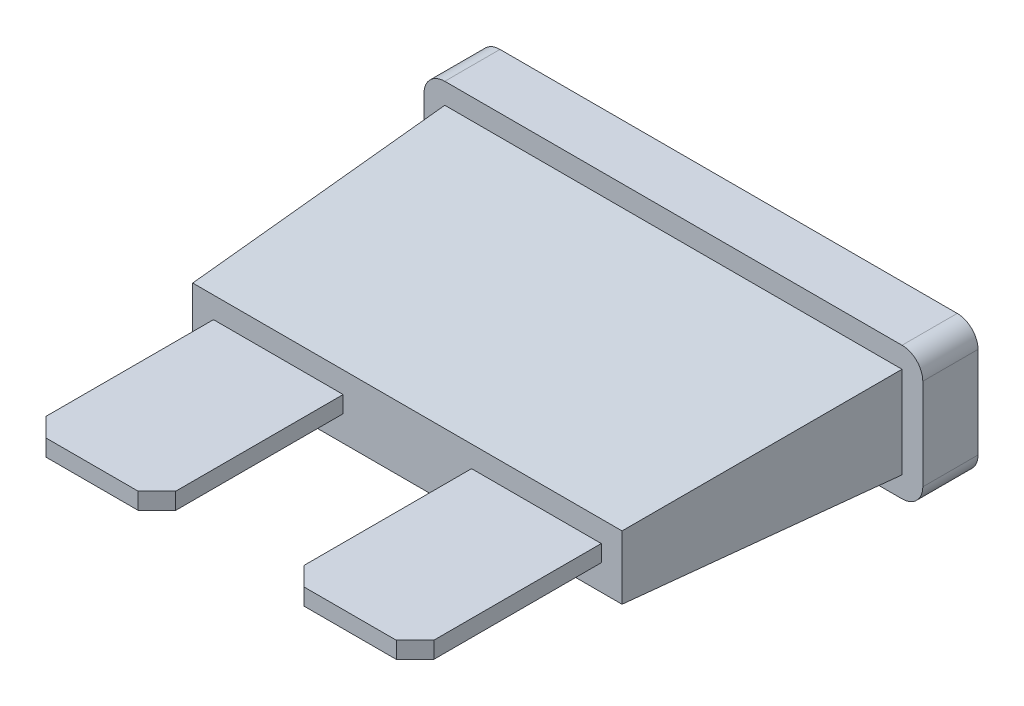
ISO-10303-21;
HEADER;
FILE_DESCRIPTION(('STEP AP214'),'2;1');
FILE_NAME('part.step','',(''),(''),'','','');
FILE_SCHEMA(('AUTOMOTIVE_DESIGN { 1 0 10303 214 1 1 1 1 }'));
ENDSEC;
DATA;
#1=APPLICATION_CONTEXT('core data for automotive mechanical design processes');
#2=APPLICATION_PROTOCOL_DEFINITION('international standard','automotive_design',2000,#1);
#3=PRODUCT_CONTEXT('',#1,'mechanical');
#4=PRODUCT('Part','Part','',(#3));
#5=PRODUCT_RELATED_PRODUCT_CATEGORY('part','',(#4));
#6=PRODUCT_DEFINITION_FORMATION('','',#4);
#7=PRODUCT_DEFINITION_CONTEXT('part definition',#1,'design');
#8=PRODUCT_DEFINITION('design','',#6,#7);
#9=PRODUCT_DEFINITION_SHAPE('','',#8);
#10=(LENGTH_UNIT() NAMED_UNIT(*) SI_UNIT(.MILLI.,.METRE.));
#11=(NAMED_UNIT(*) PLANE_ANGLE_UNIT() SI_UNIT($,.RADIAN.));
#12=(NAMED_UNIT(*) SI_UNIT($,.STERADIAN.) SOLID_ANGLE_UNIT());
#13=UNCERTAINTY_MEASURE_WITH_UNIT(LENGTH_MEASURE(1.E-05),#10,'distance_accuracy_value','');
#14=(GEOMETRIC_REPRESENTATION_CONTEXT(3) GLOBAL_UNCERTAINTY_ASSIGNED_CONTEXT((#13)) GLOBAL_UNIT_ASSIGNED_CONTEXT((#10,
#11,#12)) REPRESENTATION_CONTEXT('',''));
#15=CARTESIAN_POINT('',(0.,0.,0.));
#16=DIRECTION('',(0.,0.,1.));
#17=DIRECTION('',(1.,0.,0.));
#18=AXIS2_PLACEMENT_3D('',#15,#16,#17);
#19=CARTESIAN_POINT('',(6.44405312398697,-15.5105088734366,12.2682));
#20=DIRECTION('',(1.,0.,0.));
#21=DIRECTION('',(0.,0.,-1.));
#22=AXIS2_PLACEMENT_3D('',#19,#20,#21);
#23=PLANE('',#22);
#24=DIRECTION('',(0.,0.,1.));
#25=VECTOR('',#24,1.);
#26=CARTESIAN_POINT('',(6.44405312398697,-0.235628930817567,12.2682));
#27=LINE('',#26,#25);
#28=CARTESIAN_POINT('',(6.44405312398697,-0.235628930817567,8.45802615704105));
#29=VERTEX_POINT('',#28);
#30=CARTESIAN_POINT('',(6.44405312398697,-0.235628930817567,12.2682));
#31=VERTEX_POINT('',#30);
#32=EDGE_CURVE('E62',#29,#31,#27,.T.);
#33=ORIENTED_EDGE('',*,*,#32,.F.);
#34=DIRECTION('',(0.,1.,0.));
#35=VECTOR('',#34,1.);
#36=CARTESIAN_POINT('',(6.44405312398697,-15.5105088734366,8.45802615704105));
#37=LINE('',#36,#35);
#38=CARTESIAN_POINT('',(6.44405312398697,0.399371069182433,8.45802615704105));
#39=VERTEX_POINT('',#38);
#40=EDGE_CURVE('E142',#29,#39,#37,.T.);
#41=ORIENTED_EDGE('',*,*,#40,.T.);
#42=DIRECTION('',(0.,0.,-1.));
#43=VECTOR('',#42,1.);
#44=CARTESIAN_POINT('',(6.44405312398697,0.399371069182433,12.2682));
#45=LINE('',#44,#43);
#46=CARTESIAN_POINT('',(6.44405312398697,0.399371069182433,12.2682));
#47=VERTEX_POINT('',#46);
#48=EDGE_CURVE('E259',#47,#39,#45,.T.);
#49=ORIENTED_EDGE('',*,*,#48,.F.);
#50=DIRECTION('',(0.,1.,0.));
#51=VECTOR('',#50,1.);
#52=CARTESIAN_POINT('',(6.44405312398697,-15.5105088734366,12.2682));
#53=LINE('',#52,#51);
#54=EDGE_CURVE('E162',#31,#47,#53,.T.);
#55=ORIENTED_EDGE('',*,*,#54,.F.);
#56=EDGE_LOOP('',(#33,#41,#49,#55));
#57=FACE_BOUND('',#56,.T.);
#58=ADVANCED_FACE('F54',(#57),#23,.T.);
#59=CARTESIAN_POINT('',(6.44405312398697,-15.5105088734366,12.2682));
#60=DIRECTION('',(0.,0.,1.));
#61=DIRECTION('',(1.,0.,0.));
#62=AXIS2_PLACEMENT_3D('',#59,#60,#61);
#63=PLANE('',#62);
#64=DIRECTION('',(-1.,0.,0.));
#65=VECTOR('',#64,1.);
#66=CARTESIAN_POINT('',(6.44405312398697,-0.235628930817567,12.2682));
#67=LINE('',#66,#65);
#68=CARTESIAN_POINT('',(3.41302080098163,-0.235628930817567,12.2682));
#69=VERTEX_POINT('',#68);
#70=EDGE_CURVE('E302',#31,#69,#67,.T.);
#71=ORIENTED_EDGE('',*,*,#70,.F.);
#72=ORIENTED_EDGE('',*,*,#54,.T.);
#73=DIRECTION('',(1.,0.,0.));
#74=VECTOR('',#73,1.);
#75=CARTESIAN_POINT('',(6.44405312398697,0.399371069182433,12.2682));
#76=LINE('',#75,#74);
#77=CARTESIAN_POINT('',(3.41302080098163,0.399371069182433,12.2682));
#78=VERTEX_POINT('',#77);
#79=EDGE_CURVE('E144',#78,#47,#76,.T.);
#80=ORIENTED_EDGE('',*,*,#79,.F.);
#81=DIRECTION('',(0.,1.,0.));
#82=VECTOR('',#81,1.);
#83=CARTESIAN_POINT('',(3.41302080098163,-15.5105088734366,12.2682));
#84=LINE('',#83,#82);
#85=EDGE_CURVE('E165',#69,#78,#84,.T.);
#86=ORIENTED_EDGE('',*,*,#85,.F.);
#87=EDGE_LOOP('',(#71,#72,#80,#86));
#88=FACE_BOUND('',#87,.T.);
#89=ADVANCED_FACE('F305',(#88),#63,.T.);
#90=CARTESIAN_POINT('',(3.41302080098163,-15.5105088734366,12.2682));
#91=DIRECTION('',(-1.,0.,0.));
#92=DIRECTION('',(0.,0.,1.));
#93=AXIS2_PLACEMENT_3D('',#90,#91,#92);
#94=PLANE('',#93);
#95=DIRECTION('',(0.,0.,-1.));
#96=VECTOR('',#95,1.);
#97=CARTESIAN_POINT('',(3.41302080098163,-0.235628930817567,12.2682));
#98=LINE('',#97,#96);
#99=CARTESIAN_POINT('',(3.41302080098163,-0.235628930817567,9.67458072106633));
#100=VERTEX_POINT('',#99);
#101=EDGE_CURVE('E301',#69,#100,#98,.T.);
#102=ORIENTED_EDGE('',*,*,#101,.F.);
#103=ORIENTED_EDGE('',*,*,#85,.T.);
#104=DIRECTION('',(0.,0.,1.));
#105=VECTOR('',#104,1.);
#106=CARTESIAN_POINT('',(3.41302080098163,0.399371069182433,12.2682));
#107=LINE('',#106,#105);
#108=CARTESIAN_POINT('',(3.41302080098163,0.399371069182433,9.67458072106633));
#109=VERTEX_POINT('',#108);
#110=EDGE_CURVE('E151',#109,#78,#107,.T.);
#111=ORIENTED_EDGE('',*,*,#110,.F.);
#112=DIRECTION('',(0.,1.,0.));
#113=VECTOR('',#112,1.);
#114=CARTESIAN_POINT('',(3.41302080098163,-15.5105088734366,9.67458072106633));
#115=LINE('',#114,#113);
#116=EDGE_CURVE('E168',#100,#109,#115,.T.);
#117=ORIENTED_EDGE('',*,*,#116,.F.);
#118=EDGE_LOOP('',(#102,#103,#111,#117));
#119=FACE_BOUND('',#118,.T.);
#120=ADVANCED_FACE('F310',(#119),#94,.T.);
#121=CARTESIAN_POINT('',(4.55136081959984,-15.5105088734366,6.78703294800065));
#122=DIRECTION('',(0.,1.,0.));
#123=DIRECTION('',(-1.,0.,0.));
#124=AXIS2_PLACEMENT_3D('',#121,#122,#123);
#125=CYLINDRICAL_SURFACE('',#124,3.10382830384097);
#126=CARTESIAN_POINT('',(4.55136081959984,-0.235628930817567,6.78703294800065));
#127=DIRECTION('',(0.,1.,0.));
#128=DIRECTION('',(0.,0.,1.));
#129=AXIS2_PLACEMENT_3D('',#126,#127,#128);
#130=CIRCLE('',#129,3.10382830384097);
#131=CARTESIAN_POINT('',(1.44753251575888,-0.235628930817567,6.78703294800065));
#132=VERTEX_POINT('',#131);
#133=EDGE_CURVE('E299',#100,#132,#130,.F.);
#134=ORIENTED_EDGE('',*,*,#133,.F.);
#135=ORIENTED_EDGE('',*,*,#116,.T.);
#136=CARTESIAN_POINT('',(4.55136081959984,0.399371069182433,6.78703294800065));
#137=DIRECTION('',(0.,1.,0.));
#138=DIRECTION('',(1.,0.,0.));
#139=AXIS2_PLACEMENT_3D('',#136,#137,#138);
#140=CIRCLE('',#139,3.10382830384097);
#141=CARTESIAN_POINT('',(1.44753251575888,0.399371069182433,6.78703294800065));
#142=VERTEX_POINT('',#141);
#143=EDGE_CURVE('E158',#142,#109,#140,.T.);
#144=ORIENTED_EDGE('',*,*,#143,.F.);
#145=DIRECTION('',(0.,1.,0.));
#146=VECTOR('',#145,1.);
#147=CARTESIAN_POINT('',(1.44753251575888,-15.5105088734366,6.78703294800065));
#148=LINE('',#147,#146);
#149=EDGE_CURVE('E171',#132,#142,#148,.T.);
#150=ORIENTED_EDGE('',*,*,#149,.F.);
#151=EDGE_LOOP('',(#134,#135,#144,#150));
#152=FACE_BOUND('',#151,.T.);
#153=ADVANCED_FACE('F233',(#152),#125,.T.);
#154=CARTESIAN_POINT('',(0.,-15.5105088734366,6.78703294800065));
#155=DIRECTION('',(0.,1.,0.));
#156=DIRECTION('',(-1.,0.,0.));
#157=AXIS2_PLACEMENT_3D('',#154,#155,#156);
#158=CYLINDRICAL_SURFACE('',#157,1.44753251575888);
#159=CARTESIAN_POINT('',(0.,-0.235628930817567,6.78703294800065));
#160=DIRECTION('',(0.,1.,0.));
#161=DIRECTION('',(0.,0.,1.));
#162=AXIS2_PLACEMENT_3D('',#159,#160,#161);
#163=CIRCLE('',#162,1.44753251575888);
#164=CARTESIAN_POINT('',(-1.44753251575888,-0.235628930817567,6.78703294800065));
#165=VERTEX_POINT('',#164);
#166=EDGE_CURVE('E297',#132,#165,#163,.T.);
#167=ORIENTED_EDGE('',*,*,#166,.F.);
#168=ORIENTED_EDGE('',*,*,#149,.T.);
#169=CARTESIAN_POINT('',(0.,0.399371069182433,6.78703294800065));
#170=DIRECTION('',(0.,-1.,0.));
#171=DIRECTION('',(-1.,0.,0.));
#172=AXIS2_PLACEMENT_3D('',#169,#170,#171);
#173=CIRCLE('',#172,1.44753251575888);
#174=CARTESIAN_POINT('',(-1.44753251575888,0.399371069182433,6.78703294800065));
#175=VERTEX_POINT('',#174);
#176=EDGE_CURVE('E220',#175,#142,#173,.T.);
#177=ORIENTED_EDGE('',*,*,#176,.F.);
#178=DIRECTION('',(0.,1.,0.));
#179=VECTOR('',#178,1.);
#180=CARTESIAN_POINT('',(-1.44753251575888,-15.5105088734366,6.78703294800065));
#181=LINE('',#180,#179);
#182=EDGE_CURVE('E174',#165,#175,#181,.T.);
#183=ORIENTED_EDGE('',*,*,#182,.F.);
#184=EDGE_LOOP('',(#167,#168,#177,#183));
#185=FACE_BOUND('',#184,.T.);
#186=ADVANCED_FACE('F322',(#185),#158,.F.);
#187=CARTESIAN_POINT('',(-4.55136081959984,-15.5105088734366,6.78703294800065));
#188=DIRECTION('',(0.,1.,0.));
#189=DIRECTION('',(-1.,0.,0.));
#190=AXIS2_PLACEMENT_3D('',#187,#188,#189);
#191=CYLINDRICAL_SURFACE('',#190,3.10382830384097);
#192=CARTESIAN_POINT('',(-4.55136081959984,-0.235628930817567,6.78703294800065));
#193=DIRECTION('',(0.,1.,0.));
#194=DIRECTION('',(0.,0.,1.));
#195=AXIS2_PLACEMENT_3D('',#192,#193,#194);
#196=CIRCLE('',#195,3.10382830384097);
#197=CARTESIAN_POINT('',(-3.41302080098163,-0.235628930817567,9.67458072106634));
#198=VERTEX_POINT('',#197);
#199=EDGE_CURVE('E291',#165,#198,#196,.F.);
#200=ORIENTED_EDGE('',*,*,#199,.F.);
#201=ORIENTED_EDGE('',*,*,#182,.T.);
#202=CARTESIAN_POINT('',(-4.55136081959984,0.399371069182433,6.78703294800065));
#203=DIRECTION('',(0.,1.,0.));
#204=DIRECTION('',(1.,0.,0.));
#205=AXIS2_PLACEMENT_3D('',#202,#203,#204);
#206=CIRCLE('',#205,3.10382830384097);
#207=CARTESIAN_POINT('',(-3.41302080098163,0.399371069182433,9.67458072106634));
#208=VERTEX_POINT('',#207);
#209=EDGE_CURVE('E217',#208,#175,#206,.T.);
#210=ORIENTED_EDGE('',*,*,#209,.F.);
#211=DIRECTION('',(0.,1.,0.));
#212=VECTOR('',#211,1.);
#213=CARTESIAN_POINT('',(-3.41302080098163,-15.5105088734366,9.67458072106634));
#214=LINE('',#213,#212);
#215=EDGE_CURVE('E177',#198,#208,#214,.T.);
#216=ORIENTED_EDGE('',*,*,#215,.F.);
#217=EDGE_LOOP('',(#200,#201,#210,#216));
#218=FACE_BOUND('',#217,.T.);
#219=ADVANCED_FACE('F283',(#218),#191,.T.);
#220=CARTESIAN_POINT('',(-3.41302080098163,-15.5105088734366,12.2682));
#221=DIRECTION('',(1.,0.,0.));
#222=DIRECTION('',(0.,1.,0.));
#223=AXIS2_PLACEMENT_3D('',#220,#221,#222);
#224=PLANE('',#223);
#225=DIRECTION('',(0.,0.,1.));
#226=VECTOR('',#225,1.);
#227=CARTESIAN_POINT('',(-3.41302080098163,-0.235628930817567,12.2682));
#228=LINE('',#227,#226);
#229=CARTESIAN_POINT('',(-3.41302080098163,-0.235628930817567,12.2682));
#230=VERTEX_POINT('',#229);
#231=EDGE_CURVE('E280',#198,#230,#228,.T.);
#232=ORIENTED_EDGE('',*,*,#231,.F.);
#233=ORIENTED_EDGE('',*,*,#215,.T.);
#234=DIRECTION('',(0.,0.,-1.));
#235=VECTOR('',#234,1.);
#236=CARTESIAN_POINT('',(-3.41302080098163,0.399371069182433,12.2682));
#237=LINE('',#236,#235);
#238=CARTESIAN_POINT('',(-3.41302080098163,0.399371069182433,12.2682));
#239=VERTEX_POINT('',#238);
#240=EDGE_CURVE('E214',#239,#208,#237,.T.);
#241=ORIENTED_EDGE('',*,*,#240,.F.);
#242=DIRECTION('',(0.,1.,0.));
#243=VECTOR('',#242,1.);
#244=CARTESIAN_POINT('',(-3.41302080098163,-15.5105088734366,12.2682));
#245=LINE('',#244,#243);
#246=EDGE_CURVE('E180',#230,#239,#245,.T.);
#247=ORIENTED_EDGE('',*,*,#246,.F.);
#248=EDGE_LOOP('',(#232,#233,#241,#247));
#249=FACE_BOUND('',#248,.T.);
#250=ADVANCED_FACE('F278',(#249),#224,.T.);
#251=CARTESIAN_POINT('',(-3.41302080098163,-15.5105088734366,12.2682));
#252=DIRECTION('',(0.,0.,1.));
#253=DIRECTION('',(1.,0.,0.));
#254=AXIS2_PLACEMENT_3D('',#251,#252,#253);
#255=PLANE('',#254);
#256=DIRECTION('',(-1.,0.,0.));
#257=VECTOR('',#256,1.);
#258=CARTESIAN_POINT('',(-3.41302080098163,-0.235628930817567,12.2682));
#259=LINE('',#258,#257);
#260=CARTESIAN_POINT('',(-6.44405312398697,-0.235628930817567,12.2682));
#261=VERTEX_POINT('',#260);
#262=EDGE_CURVE('E288',#230,#261,#259,.T.);
#263=ORIENTED_EDGE('',*,*,#262,.F.);
#264=ORIENTED_EDGE('',*,*,#246,.T.);
#265=DIRECTION('',(1.,0.,0.));
#266=VECTOR('',#265,1.);
#267=CARTESIAN_POINT('',(-3.41302080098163,0.399371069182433,12.2682));
#268=LINE('',#267,#266);
#269=CARTESIAN_POINT('',(-6.44405312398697,0.399371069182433,12.2682));
#270=VERTEX_POINT('',#269);
#271=EDGE_CURVE('E205',#270,#239,#268,.T.);
#272=ORIENTED_EDGE('',*,*,#271,.F.);
#273=DIRECTION('',(0.,1.,0.));
#274=VECTOR('',#273,1.);
#275=CARTESIAN_POINT('',(-6.44405312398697,-15.5105088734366,12.2682));
#276=LINE('',#275,#274);
#277=EDGE_CURVE('E183',#261,#270,#276,.T.);
#278=ORIENTED_EDGE('',*,*,#277,.F.);
#279=EDGE_LOOP('',(#263,#264,#272,#278));
#280=FACE_BOUND('',#279,.T.);
#281=ADVANCED_FACE('F287',(#280),#255,.T.);
#282=CARTESIAN_POINT('',(-6.44405312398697,-15.5105088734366,12.2682));
#283=DIRECTION('',(-1.,0.,0.));
#284=DIRECTION('',(0.,-1.,0.));
#285=AXIS2_PLACEMENT_3D('',#282,#283,#284);
#286=PLANE('',#285);
#287=DIRECTION('',(0.,0.,-1.));
#288=VECTOR('',#287,1.);
#289=CARTESIAN_POINT('',(-6.44405312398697,-0.235628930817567,12.2682));
#290=LINE('',#289,#288);
#291=CARTESIAN_POINT('',(-6.44405312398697,-0.235628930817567,8.45802615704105));
#292=VERTEX_POINT('',#291);
#293=EDGE_CURVE('E289',#261,#292,#290,.T.);
#294=ORIENTED_EDGE('',*,*,#293,.F.);
#295=ORIENTED_EDGE('',*,*,#277,.T.);
#296=DIRECTION('',(0.,0.,1.));
#297=VECTOR('',#296,1.);
#298=CARTESIAN_POINT('',(-6.44405312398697,0.399371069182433,12.2682));
#299=LINE('',#298,#297);
#300=CARTESIAN_POINT('',(-6.44405312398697,0.399371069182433,8.45802615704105));
#301=VERTEX_POINT('',#300);
#302=EDGE_CURVE('E200',#301,#270,#299,.T.);
#303=ORIENTED_EDGE('',*,*,#302,.F.);
#304=DIRECTION('',(0.,1.,0.));
#305=VECTOR('',#304,1.);
#306=CARTESIAN_POINT('',(-6.44405312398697,-15.5105088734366,8.45802615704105));
#307=LINE('',#306,#305);
#308=EDGE_CURVE('E135',#292,#301,#307,.T.);
#309=ORIENTED_EDGE('',*,*,#308,.F.);
#310=EDGE_LOOP('',(#294,#295,#303,#309));
#311=FACE_BOUND('',#310,.T.);
#312=ADVANCED_FACE('F201',(#311),#286,.T.);
#313=CARTESIAN_POINT('',(-3.79590867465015,-15.5105088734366,8.45802615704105));
#314=DIRECTION('',(0.,0.,-1.));
#315=DIRECTION('',(-1.,0.,0.));
#316=AXIS2_PLACEMENT_3D('',#313,#314,#315);
#317=PLANE('',#316);
#318=DIRECTION('',(1.,0.,0.));
#319=VECTOR('',#318,1.);
#320=CARTESIAN_POINT('',(-3.79590867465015,-0.235628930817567,8.45802615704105));
#321=LINE('',#320,#319);
#322=CARTESIAN_POINT('',(-3.79590867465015,-0.235628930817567,8.45802615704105));
#323=VERTEX_POINT('',#322);
#324=EDGE_CURVE('E111',#292,#323,#321,.T.);
#325=ORIENTED_EDGE('',*,*,#324,.F.);
#326=ORIENTED_EDGE('',*,*,#308,.T.);
#327=DIRECTION('',(-1.,0.,0.));
#328=VECTOR('',#327,1.);
#329=CARTESIAN_POINT('',(-3.79590867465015,0.399371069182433,8.45802615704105));
#330=LINE('',#329,#328);
#331=CARTESIAN_POINT('',(-3.79590867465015,0.399371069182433,8.45802615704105));
#332=VERTEX_POINT('',#331);
#333=EDGE_CURVE('E194',#332,#301,#330,.T.);
#334=ORIENTED_EDGE('',*,*,#333,.F.);
#335=DIRECTION('',(0.,1.,0.));
#336=VECTOR('',#335,1.);
#337=CARTESIAN_POINT('',(-3.79590867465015,-15.5105088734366,8.45802615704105));
#338=LINE('',#337,#336);
#339=EDGE_CURVE('E133',#323,#332,#338,.T.);
#340=ORIENTED_EDGE('',*,*,#339,.F.);
#341=EDGE_LOOP('',(#325,#326,#334,#340));
#342=FACE_BOUND('',#341,.T.);
#343=ADVANCED_FACE('F191',(#342),#317,.T.);
#344=CARTESIAN_POINT('',(-4.55136081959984,-15.5105088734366,6.78703294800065));
#345=DIRECTION('',(0.,1.,0.));
#346=DIRECTION('',(-1.,0.,0.));
#347=AXIS2_PLACEMENT_3D('',#344,#345,#346);
#348=CYLINDRICAL_SURFACE('',#347,1.83382830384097);
#349=CARTESIAN_POINT('',(-4.55136081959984,-0.235628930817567,6.78703294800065));
#350=DIRECTION('',(0.,1.,0.));
#351=DIRECTION('',(0.,0.,1.));
#352=AXIS2_PLACEMENT_3D('',#349,#350,#351);
#353=CIRCLE('',#352,1.83382830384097);
#354=CARTESIAN_POINT('',(-2.71753251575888,-0.235628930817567,6.78703294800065));
#355=VERTEX_POINT('',#354);
#356=EDGE_CURVE('E105',#323,#355,#353,.T.);
#357=ORIENTED_EDGE('',*,*,#356,.F.);
#358=ORIENTED_EDGE('',*,*,#339,.T.);
#359=CARTESIAN_POINT('',(-4.55136081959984,0.399371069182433,6.78703294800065));
#360=DIRECTION('',(0.,-1.,0.));
#361=DIRECTION('',(1.,0.,0.));
#362=AXIS2_PLACEMENT_3D('',#359,#360,#361);
#363=CIRCLE('',#362,1.83382830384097);
#364=CARTESIAN_POINT('',(-2.71753251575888,0.399371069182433,6.78703294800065));
#365=VERTEX_POINT('',#364);
#366=EDGE_CURVE('E131',#365,#332,#363,.T.);
#367=ORIENTED_EDGE('',*,*,#366,.F.);
#368=DIRECTION('',(0.,1.,0.));
#369=VECTOR('',#368,1.);
#370=CARTESIAN_POINT('',(-2.71753251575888,-15.5105088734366,6.78703294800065));
#371=LINE('',#370,#369);
#372=EDGE_CURVE('E123',#355,#365,#371,.T.);
#373=ORIENTED_EDGE('',*,*,#372,.F.);
#374=EDGE_LOOP('',(#357,#358,#367,#373));
#375=FACE_BOUND('',#374,.T.);
#376=ADVANCED_FACE('F129',(#375),#348,.F.);
#377=CARTESIAN_POINT('',(0.,-15.5105088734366,6.78703294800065));
#378=DIRECTION('',(0.,1.,0.));
#379=DIRECTION('',(-1.,0.,0.));
#380=AXIS2_PLACEMENT_3D('',#377,#378,#379);
#381=CYLINDRICAL_SURFACE('',#380,2.71753251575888);
#382=CARTESIAN_POINT('',(0.,-0.235628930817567,6.78703294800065));
#383=DIRECTION('',(0.,1.,0.));
#384=DIRECTION('',(0.,0.,1.));
#385=AXIS2_PLACEMENT_3D('',#382,#383,#384);
#386=CIRCLE('',#385,2.71753251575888);
#387=CARTESIAN_POINT('',(2.71753251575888,-0.235628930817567,6.78703294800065));
#388=VERTEX_POINT('',#387);
#389=EDGE_CURVE('E108',#355,#388,#386,.F.);
#390=ORIENTED_EDGE('',*,*,#389,.F.);
#391=ORIENTED_EDGE('',*,*,#372,.T.);
#392=CARTESIAN_POINT('',(0.,0.399371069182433,6.78703294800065));
#393=DIRECTION('',(0.,1.,0.));
#394=DIRECTION('',(-1.,0.,0.));
#395=AXIS2_PLACEMENT_3D('',#392,#393,#394);
#396=CIRCLE('',#395,2.71753251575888);
#397=CARTESIAN_POINT('',(2.71753251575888,0.399371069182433,6.78703294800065));
#398=VERTEX_POINT('',#397);
#399=EDGE_CURVE('E209',#398,#365,#396,.T.);
#400=ORIENTED_EDGE('',*,*,#399,.F.);
#401=DIRECTION('',(0.,1.,0.));
#402=VECTOR('',#401,1.);
#403=CARTESIAN_POINT('',(2.71753251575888,-15.5105088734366,6.78703294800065));
#404=LINE('',#403,#402);
#405=EDGE_CURVE('E126',#388,#398,#404,.T.);
#406=ORIENTED_EDGE('',*,*,#405,.F.);
#407=EDGE_LOOP('',(#390,#391,#400,#406));
#408=FACE_BOUND('',#407,.T.);
#409=ADVANCED_FACE('F120',(#408),#381,.T.);
#410=CARTESIAN_POINT('',(4.55136081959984,-15.5105088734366,6.78703294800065));
#411=DIRECTION('',(0.,1.,0.));
#412=DIRECTION('',(-1.,0.,0.));
#413=AXIS2_PLACEMENT_3D('',#410,#411,#412);
#414=CYLINDRICAL_SURFACE('',#413,1.83382830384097);
#415=CARTESIAN_POINT('',(4.55136081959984,-0.235628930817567,6.78703294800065));
#416=DIRECTION('',(0.,1.,0.));
#417=DIRECTION('',(0.,0.,1.));
#418=AXIS2_PLACEMENT_3D('',#415,#416,#417);
#419=CIRCLE('',#418,1.83382830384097);
#420=CARTESIAN_POINT('',(3.79590867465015,-0.235628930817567,8.45802615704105));
#421=VERTEX_POINT('',#420);
#422=EDGE_CURVE('E127',#388,#421,#419,.T.);
#423=ORIENTED_EDGE('',*,*,#422,.F.);
#424=ORIENTED_EDGE('',*,*,#405,.T.);
#425=CARTESIAN_POINT('',(4.55136081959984,0.399371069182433,6.78703294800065));
#426=DIRECTION('',(0.,-1.,0.));
#427=DIRECTION('',(1.,0.,0.));
#428=AXIS2_PLACEMENT_3D('',#425,#426,#427);
#429=CIRCLE('',#428,1.83382830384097);
#430=CARTESIAN_POINT('',(3.79590867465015,0.399371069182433,8.45802615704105));
#431=VERTEX_POINT('',#430);
#432=EDGE_CURVE('E253',#431,#398,#429,.T.);
#433=ORIENTED_EDGE('',*,*,#432,.F.);
#434=DIRECTION('',(0.,1.,0.));
#435=VECTOR('',#434,1.);
#436=CARTESIAN_POINT('',(3.79590867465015,-15.5105088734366,8.45802615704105));
#437=LINE('',#436,#435);
#438=EDGE_CURVE('E137',#421,#431,#437,.T.);
#439=ORIENTED_EDGE('',*,*,#438,.F.);
#440=EDGE_LOOP('',(#423,#424,#433,#439));
#441=FACE_BOUND('',#440,.T.);
#442=ADVANCED_FACE('F250',(#441),#414,.F.);
#443=CARTESIAN_POINT('',(6.44405312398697,-15.5105088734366,8.45802615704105));
#444=DIRECTION('',(0.,0.,-1.));
#445=DIRECTION('',(-1.,0.,0.));
#446=AXIS2_PLACEMENT_3D('',#443,#444,#445);
#447=PLANE('',#446);
#448=DIRECTION('',(1.,0.,0.));
#449=VECTOR('',#448,1.);
#450=CARTESIAN_POINT('',(6.44405312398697,-0.235628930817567,8.45802615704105));
#451=LINE('',#450,#449);
#452=EDGE_CURVE('E14',#421,#29,#451,.T.);
#453=ORIENTED_EDGE('',*,*,#452,.F.);
#454=ORIENTED_EDGE('',*,*,#438,.T.);
#455=DIRECTION('',(-1.,0.,0.));
#456=VECTOR('',#455,1.);
#457=CARTESIAN_POINT('',(6.44405312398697,0.399371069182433,8.45802615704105));
#458=LINE('',#457,#456);
#459=EDGE_CURVE('E257',#39,#431,#458,.T.);
#460=ORIENTED_EDGE('',*,*,#459,.F.);
#461=ORIENTED_EDGE('',*,*,#40,.F.);
#462=EDGE_LOOP('',(#453,#454,#460,#461));
#463=FACE_BOUND('',#462,.T.);
#464=ADVANCED_FACE('F256',(#463),#447,.T.);
#465=CARTESIAN_POINT('',(4.55136081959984,0.399371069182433,6.78703294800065));
#466=DIRECTION('',(0.,-1.,0.));
#467=DIRECTION('',(1.,0.,0.));
#468=AXIS2_PLACEMENT_3D('',#465,#466,#467);
#469=PLANE('',#468);
#470=ORIENTED_EDGE('',*,*,#48,.T.);
#471=ORIENTED_EDGE('',*,*,#459,.T.);
#472=ORIENTED_EDGE('',*,*,#432,.T.);
#473=ORIENTED_EDGE('',*,*,#399,.T.);
#474=ORIENTED_EDGE('',*,*,#366,.T.);
#475=ORIENTED_EDGE('',*,*,#333,.T.);
#476=ORIENTED_EDGE('',*,*,#302,.T.);
#477=ORIENTED_EDGE('',*,*,#271,.T.);
#478=ORIENTED_EDGE('',*,*,#240,.T.);
#479=ORIENTED_EDGE('',*,*,#209,.T.);
#480=ORIENTED_EDGE('',*,*,#176,.T.);
#481=ORIENTED_EDGE('',*,*,#143,.T.);
#482=ORIENTED_EDGE('',*,*,#110,.T.);
#483=ORIENTED_EDGE('',*,*,#79,.T.);
#484=EDGE_LOOP('',(#470,#471,#472,#473,#474,#475,#476,#477,#478,#479,#480,#481,#482,#483));
#485=FACE_BOUND('',#484,.T.);
#486=ADVANCED_FACE('F207',(#485),#469,.F.);
#487=CARTESIAN_POINT('',(-7.40503696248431,-0.235628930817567,19.3802));
#488=DIRECTION('',(0.,1.,0.));
#489=DIRECTION('',(0.,0.,1.));
#490=AXIS2_PLACEMENT_3D('',#487,#488,#489);
#491=PLANE('',#490);
#492=ORIENTED_EDGE('',*,*,#32,.T.);
#493=ORIENTED_EDGE('',*,*,#70,.T.);
#494=ORIENTED_EDGE('',*,*,#101,.T.);
#495=ORIENTED_EDGE('',*,*,#133,.T.);
#496=ORIENTED_EDGE('',*,*,#166,.T.);
#497=ORIENTED_EDGE('',*,*,#199,.T.);
#498=ORIENTED_EDGE('',*,*,#231,.T.);
#499=ORIENTED_EDGE('',*,*,#262,.T.);
#500=ORIENTED_EDGE('',*,*,#293,.T.);
#501=ORIENTED_EDGE('',*,*,#324,.T.);
#502=ORIENTED_EDGE('',*,*,#356,.T.);
#503=ORIENTED_EDGE('',*,*,#389,.T.);
#504=ORIENTED_EDGE('',*,*,#422,.T.);
#505=ORIENTED_EDGE('',*,*,#452,.T.);
#506=EDGE_LOOP('',(#492,#493,#494,#495,#496,#497,#498,#499,#500,#501,#502,#503,#504,#505));
#507=FACE_BOUND('',#506,.T.);
#508=ADVANCED_FACE('F107',(#507),#491,.F.);
#509=CLOSED_SHELL('',(#58,#89,#120,#153,#186,#219,#250,#281,#312,#343,#376,#409,#442,#464,#486,#508));
#510=MANIFOLD_SOLID_BREP('B2',#509);
#511=CARTESIAN_POINT('',(-8.73125000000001,1.74625,12.2682));
#512=DIRECTION('',(0.,0.,1.));
#513=DIRECTION('',(1.,0.,0.));
#514=AXIS2_PLACEMENT_3D('',#511,#512,#513);
#515=PLANE('',#514);
#516=DIRECTION('',(1.,0.,0.));
#517=VECTOR('',#516,1.);
#518=CARTESIAN_POINT('',(-7.40503696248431,-0.235628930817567,12.2682));
#519=LINE('',#518,#517);
#520=CARTESIAN_POINT('',(-7.40503696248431,-0.235628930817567,12.2682));
#521=VERTEX_POINT('',#520);
#522=CARTESIAN_POINT('',(-2.45203696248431,-0.235628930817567,12.2682));
#523=VERTEX_POINT('',#522);
#524=EDGE_CURVE('E784',#521,#523,#519,.T.);
#525=ORIENTED_EDGE('',*,*,#524,.F.);
#526=DIRECTION('',(0.,-1.,0.));
#527=VECTOR('',#526,1.);
#528=CARTESIAN_POINT('',(-7.40503696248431,0.399371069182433,12.2682));
#529=LINE('',#528,#527);
#530=CARTESIAN_POINT('',(-7.40503696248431,0.399371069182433,12.2682));
#531=VERTEX_POINT('',#530);
#532=EDGE_CURVE('E781',#531,#521,#529,.T.);
#533=ORIENTED_EDGE('',*,*,#532,.F.);
#534=DIRECTION('',(-1.,0.,0.));
#535=VECTOR('',#534,1.);
#536=CARTESIAN_POINT('',(-7.40503696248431,0.399371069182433,12.2682));
#537=LINE('',#536,#535);
#538=CARTESIAN_POINT('',(-2.45203696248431,0.399371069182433,12.2682));
#539=VERTEX_POINT('',#538);
#540=EDGE_CURVE('E777',#539,#531,#537,.T.);
#541=ORIENTED_EDGE('',*,*,#540,.F.);
#542=DIRECTION('',(0.,1.,0.));
#543=VECTOR('',#542,1.);
#544=CARTESIAN_POINT('',(-2.45203696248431,0.399371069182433,12.2682));
#545=LINE('',#544,#543);
#546=EDGE_CURVE('E788',#523,#539,#545,.T.);
#547=ORIENTED_EDGE('',*,*,#546,.F.);
#548=EDGE_LOOP('',(#525,#533,#541,#547));
#549=FACE_BOUND('',#548,.T.);
#550=DIRECTION('',(1.,0.,0.));
#551=VECTOR('',#550,1.);
#552=CARTESIAN_POINT('',(8.73125,1.2137869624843,12.2682));
#553=LINE('',#552,#551);
#554=CARTESIAN_POINT('',(8.1987869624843,1.2137869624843,12.2682));
#555=VERTEX_POINT('',#554);
#556=CARTESIAN_POINT('',(-8.19878696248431,1.2137869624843,12.2682));
#557=VERTEX_POINT('',#556);
#558=EDGE_CURVE('E809',#555,#557,#553,.F.);
#559=ORIENTED_EDGE('',*,*,#558,.T.);
#560=DIRECTION('',(0.,1.,0.));
#561=VECTOR('',#560,1.);
#562=CARTESIAN_POINT('',(-8.19878696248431,1.74625,12.2682));
#563=LINE('',#562,#561);
#564=CARTESIAN_POINT('',(-8.19878696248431,-1.2137869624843,12.2682));
#565=VERTEX_POINT('',#564);
#566=EDGE_CURVE('E826',#557,#565,#563,.F.);
#567=ORIENTED_EDGE('',*,*,#566,.T.);
#568=DIRECTION('',(-1.,0.,0.));
#569=VECTOR('',#568,1.);
#570=CARTESIAN_POINT('',(-8.73125000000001,-1.2137869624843,12.2682));
#571=LINE('',#570,#569);
#572=CARTESIAN_POINT('',(8.1987869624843,-1.2137869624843,12.2682));
#573=VERTEX_POINT('',#572);
#574=EDGE_CURVE('E828',#565,#573,#571,.F.);
#575=ORIENTED_EDGE('',*,*,#574,.T.);
#576=DIRECTION('',(0.,-1.,0.));
#577=VECTOR('',#576,1.);
#578=CARTESIAN_POINT('',(8.1987869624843,-1.74625,12.2682));
#579=LINE('',#578,#577);
#580=EDGE_CURVE('E819',#573,#555,#579,.F.);
#581=ORIENTED_EDGE('',*,*,#580,.T.);
#582=EDGE_LOOP('',(#559,#567,#575,#581));
#583=FACE_BOUND('',#582,.T.);
#584=DIRECTION('',(1.,0.,0.));
#585=VECTOR('',#584,1.);
#586=CARTESIAN_POINT('',(2.4520369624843,-0.235628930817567,12.2682));
#587=LINE('',#586,#585);
#588=CARTESIAN_POINT('',(2.4520369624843,-0.235628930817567,12.2682));
#589=VERTEX_POINT('',#588);
#590=CARTESIAN_POINT('',(7.4050369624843,-0.235628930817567,12.2682));
#591=VERTEX_POINT('',#590);
#592=EDGE_CURVE('E1138',#589,#591,#587,.T.);
#593=ORIENTED_EDGE('',*,*,#592,.F.);
#594=DIRECTION('',(0.,-1.,0.));
#595=VECTOR('',#594,1.);
#596=CARTESIAN_POINT('',(2.4520369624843,0.399371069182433,12.2682));
#597=LINE('',#596,#595);
#598=CARTESIAN_POINT('',(2.4520369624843,0.399371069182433,12.2682));
#599=VERTEX_POINT('',#598);
#600=EDGE_CURVE('E1110',#599,#589,#597,.T.);
#601=ORIENTED_EDGE('',*,*,#600,.F.);
#602=DIRECTION('',(-1.,0.,0.));
#603=VECTOR('',#602,1.);
#604=CARTESIAN_POINT('',(2.4520369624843,0.399371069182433,12.2682));
#605=LINE('',#604,#603);
#606=CARTESIAN_POINT('',(7.40503696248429,0.399371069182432,12.2682));
#607=VERTEX_POINT('',#606);
#608=EDGE_CURVE('E1132',#607,#599,#605,.T.);
#609=ORIENTED_EDGE('',*,*,#608,.F.);
#610=DIRECTION('',(0.,1.,0.));
#611=VECTOR('',#610,1.);
#612=CARTESIAN_POINT('',(7.4050369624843,0.399371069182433,12.2682));
#613=LINE('',#612,#611);
#614=EDGE_CURVE('E1141',#591,#607,#613,.T.);
#615=ORIENTED_EDGE('',*,*,#614,.F.);
#616=EDGE_LOOP('',(#593,#601,#609,#615));
#617=FACE_BOUND('',#616,.T.);
#618=ADVANCED_FACE('F442',(#549,#583,#617),#515,.T.);
#619=CARTESIAN_POINT('',(8.73125,1.74625,2.1082));
#620=DIRECTION('',(0.,0.,-1.));
#621=DIRECTION('',(-1.,0.,0.));
#622=AXIS2_PLACEMENT_3D('',#619,#620,#621);
#623=PLANE('',#622);
#624=CARTESIAN_POINT('',(8.73125,1.74625,2.1082));
#625=DIRECTION('',(0.,0.,1.));
#626=DIRECTION('',(-1.,0.,0.));
#627=AXIS2_PLACEMENT_3D('',#624,#625,#626);
#628=CIRCLE('',#627,0.79375);
#629=CARTESIAN_POINT('',(9.525,1.74624999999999,2.1082));
#630=VERTEX_POINT('',#629);
#631=CARTESIAN_POINT('',(8.73124999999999,2.54,2.1082));
#632=VERTEX_POINT('',#631);
#633=EDGE_CURVE('E831',#630,#632,#628,.T.);
#634=ORIENTED_EDGE('',*,*,#633,.T.);
#635=DIRECTION('',(-1.,0.,0.));
#636=VECTOR('',#635,1.);
#637=CARTESIAN_POINT('',(-8.73125,2.54,2.1082));
#638=LINE('',#637,#636);
#639=CARTESIAN_POINT('',(-8.73125,2.54,2.1082));
#640=VERTEX_POINT('',#639);
#641=EDGE_CURVE('E834',#632,#640,#638,.T.);
#642=ORIENTED_EDGE('',*,*,#641,.T.);
#643=CARTESIAN_POINT('',(-8.73125000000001,1.74625,2.1082));
#644=DIRECTION('',(0.,0.,1.));
#645=DIRECTION('',(1.,0.,0.));
#646=AXIS2_PLACEMENT_3D('',#643,#644,#645);
#647=CIRCLE('',#646,0.79375);
#648=CARTESIAN_POINT('',(-9.52500000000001,1.74624999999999,2.1082));
#649=VERTEX_POINT('',#648);
#650=EDGE_CURVE('E837',#640,#649,#647,.T.);
#651=ORIENTED_EDGE('',*,*,#650,.T.);
#652=DIRECTION('',(0.,-1.,0.));
#653=VECTOR('',#652,1.);
#654=CARTESIAN_POINT('',(-9.52500000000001,1.74624999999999,2.1082));
#655=LINE('',#654,#653);
#656=CARTESIAN_POINT('',(-9.52500000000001,-1.74624999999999,2.1082));
#657=VERTEX_POINT('',#656);
#658=EDGE_CURVE('E839',#649,#657,#655,.T.);
#659=ORIENTED_EDGE('',*,*,#658,.T.);
#660=CARTESIAN_POINT('',(-8.73125000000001,-1.74625,2.1082));
#661=DIRECTION('',(0.,0.,1.));
#662=DIRECTION('',(1.,0.,0.));
#663=AXIS2_PLACEMENT_3D('',#660,#661,#662);
#664=CIRCLE('',#663,0.79375);
#665=CARTESIAN_POINT('',(-8.73125,-2.54,2.1082));
#666=VERTEX_POINT('',#665);
#667=EDGE_CURVE('E841',#657,#666,#664,.T.);
#668=ORIENTED_EDGE('',*,*,#667,.T.);
#669=DIRECTION('',(1.,0.,0.));
#670=VECTOR('',#669,1.);
#671=CARTESIAN_POINT('',(-8.73125,-2.54,2.1082));
#672=LINE('',#671,#670);
#673=CARTESIAN_POINT('',(8.73124999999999,-2.54,2.1082));
#674=VERTEX_POINT('',#673);
#675=EDGE_CURVE('E843',#666,#674,#672,.T.);
#676=ORIENTED_EDGE('',*,*,#675,.T.);
#677=CARTESIAN_POINT('',(8.73125,-1.74625,2.1082));
#678=DIRECTION('',(0.,0.,1.));
#679=DIRECTION('',(1.,0.,0.));
#680=AXIS2_PLACEMENT_3D('',#677,#678,#679);
#681=CIRCLE('',#680,0.79375);
#682=CARTESIAN_POINT('',(9.525,-1.74625,2.1082));
#683=VERTEX_POINT('',#682);
#684=EDGE_CURVE('E845',#674,#683,#681,.T.);
#685=ORIENTED_EDGE('',*,*,#684,.T.);
#686=DIRECTION('',(0.,1.,0.));
#687=VECTOR('',#686,1.);
#688=CARTESIAN_POINT('',(9.525,1.74624999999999,2.1082));
#689=LINE('',#688,#687);
#690=EDGE_CURVE('E847',#683,#630,#689,.T.);
#691=ORIENTED_EDGE('',*,*,#690,.T.);
#692=EDGE_LOOP('',(#634,#642,#651,#659,#668,#676,#685,#691));
#693=FACE_BOUND('',#692,.T.);
#694=DIRECTION('',(-1.,0.,0.));
#695=VECTOR('',#694,1.);
#696=CARTESIAN_POINT('',(8.73125,1.74625,2.1082));
#697=LINE('',#696,#695);
#698=CARTESIAN_POINT('',(8.73125,1.74625,2.1082));
#699=VERTEX_POINT('',#698);
#700=CARTESIAN_POINT('',(-8.73125,1.74625,2.1082));
#701=VERTEX_POINT('',#700);
#702=EDGE_CURVE('E797',#699,#701,#697,.T.);
#703=ORIENTED_EDGE('',*,*,#702,.F.);
#704=DIRECTION('',(0.,1.,0.));
#705=VECTOR('',#704,1.);
#706=CARTESIAN_POINT('',(8.73125,-1.74625,2.1082));
#707=LINE('',#706,#705);
#708=CARTESIAN_POINT('',(8.73125,-1.74625,2.1082));
#709=VERTEX_POINT('',#708);
#710=EDGE_CURVE('E806',#709,#699,#707,.T.);
#711=ORIENTED_EDGE('',*,*,#710,.F.);
#712=DIRECTION('',(1.,0.,0.));
#713=VECTOR('',#712,1.);
#714=CARTESIAN_POINT('',(-8.73125000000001,-1.74625,2.1082));
#715=LINE('',#714,#713);
#716=CARTESIAN_POINT('',(-8.73125,-1.74625,2.1082));
#717=VERTEX_POINT('',#716);
#718=EDGE_CURVE('E803',#717,#709,#715,.T.);
#719=ORIENTED_EDGE('',*,*,#718,.F.);
#720=DIRECTION('',(0.,-1.,0.));
#721=VECTOR('',#720,1.);
#722=CARTESIAN_POINT('',(-8.73125000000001,1.74625,2.1082));
#723=LINE('',#722,#721);
#724=EDGE_CURVE('E800',#701,#717,#723,.T.);
#725=ORIENTED_EDGE('',*,*,#724,.F.);
#726=EDGE_LOOP('',(#703,#711,#719,#725));
#727=FACE_BOUND('',#726,.T.);
#728=ADVANCED_FACE('F1190',(#693,#727),#623,.F.);
#729=CARTESIAN_POINT('',(8.73125,1.74625,2.1082));
#730=DIRECTION('',(0.,0.,-1.));
#731=DIRECTION('',(-1.,0.,0.));
#732=AXIS2_PLACEMENT_3D('',#729,#730,#731);
#733=CYLINDRICAL_SURFACE('',#732,0.79375);
#734=CARTESIAN_POINT('',(8.73125,1.74625,0.));
#735=DIRECTION('',(0.,0.,1.));
#736=DIRECTION('',(-1.,0.,0.));
#737=AXIS2_PLACEMENT_3D('',#734,#735,#736);
#738=CIRCLE('',#737,0.79375);
#739=CARTESIAN_POINT('',(9.525,1.74624999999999,0.));
#740=VERTEX_POINT('',#739);
#741=CARTESIAN_POINT('',(8.73124999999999,2.54,0.));
#742=VERTEX_POINT('',#741);
#743=EDGE_CURVE('E813',#740,#742,#738,.T.);
#744=ORIENTED_EDGE('',*,*,#743,.T.);
#745=DIRECTION('',(0.,0.,-1.));
#746=VECTOR('',#745,1.);
#747=CARTESIAN_POINT('',(8.73124999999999,2.54,2.1082));
#748=LINE('',#747,#746);
#749=EDGE_CURVE('E885',#632,#742,#748,.T.);
#750=ORIENTED_EDGE('',*,*,#749,.F.);
#751=ORIENTED_EDGE('',*,*,#633,.F.);
#752=DIRECTION('',(0.,0.,-1.));
#753=VECTOR('',#752,1.);
#754=CARTESIAN_POINT('',(9.525,1.74624999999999,2.1082));
#755=LINE('',#754,#753);
#756=EDGE_CURVE('E849',#630,#740,#755,.T.);
#757=ORIENTED_EDGE('',*,*,#756,.T.);
#758=EDGE_LOOP('',(#744,#750,#751,#757));
#759=FACE_BOUND('',#758,.T.);
#760=ADVANCED_FACE('F444',(#759),#733,.T.);
#761=CARTESIAN_POINT('',(-8.73125,2.54,2.1082));
#762=DIRECTION('',(0.,-1.,0.));
#763=DIRECTION('',(0.,0.,-1.));
#764=AXIS2_PLACEMENT_3D('',#761,#762,#763);
#765=PLANE('',#764);
#766=DIRECTION('',(-1.,0.,0.));
#767=VECTOR('',#766,1.);
#768=CARTESIAN_POINT('',(-8.73125,2.54,0.));
#769=LINE('',#768,#767);
#770=CARTESIAN_POINT('',(-8.73125,2.54,0.));
#771=VERTEX_POINT('',#770);
#772=EDGE_CURVE('E852',#742,#771,#769,.T.);
#773=ORIENTED_EDGE('',*,*,#772,.T.);
#774=DIRECTION('',(0.,0.,-1.));
#775=VECTOR('',#774,1.);
#776=CARTESIAN_POINT('',(-8.73125,2.54,2.1082));
#777=LINE('',#776,#775);
#778=EDGE_CURVE('E882',#640,#771,#777,.T.);
#779=ORIENTED_EDGE('',*,*,#778,.F.);
#780=ORIENTED_EDGE('',*,*,#641,.F.);
#781=ORIENTED_EDGE('',*,*,#749,.T.);
#782=EDGE_LOOP('',(#773,#779,#780,#781));
#783=FACE_BOUND('',#782,.T.);
#784=ADVANCED_FACE('F1246',(#783),#765,.F.);
#785=CARTESIAN_POINT('',(-8.73125000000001,1.74625,2.1082));
#786=DIRECTION('',(0.,0.,-1.));
#787=DIRECTION('',(-1.,0.,0.));
#788=AXIS2_PLACEMENT_3D('',#785,#786,#787);
#789=CYLINDRICAL_SURFACE('',#788,0.79375);
#790=CARTESIAN_POINT('',(-8.73125000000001,1.74625,0.));
#791=DIRECTION('',(0.,0.,1.));
#792=DIRECTION('',(1.,0.,0.));
#793=AXIS2_PLACEMENT_3D('',#790,#791,#792);
#794=CIRCLE('',#793,0.79375);
#795=CARTESIAN_POINT('',(-9.52500000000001,1.74624999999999,0.));
#796=VERTEX_POINT('',#795);
#797=EDGE_CURVE('E854',#771,#796,#794,.T.);
#798=ORIENTED_EDGE('',*,*,#797,.T.);
#799=DIRECTION('',(0.,0.,-1.));
#800=VECTOR('',#799,1.);
#801=CARTESIAN_POINT('',(-9.52500000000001,1.74624999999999,2.1082));
#802=LINE('',#801,#800);
#803=EDGE_CURVE('E879',#649,#796,#802,.T.);
#804=ORIENTED_EDGE('',*,*,#803,.F.);
#805=ORIENTED_EDGE('',*,*,#650,.F.);
#806=ORIENTED_EDGE('',*,*,#778,.T.);
#807=EDGE_LOOP('',(#798,#804,#805,#806));
#808=FACE_BOUND('',#807,.T.);
#809=ADVANCED_FACE('F1243',(#808),#789,.T.);
#810=CARTESIAN_POINT('',(-9.52500000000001,1.74624999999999,2.1082));
#811=DIRECTION('',(1.,0.,0.));
#812=DIRECTION('',(0.,0.,-1.));
#813=AXIS2_PLACEMENT_3D('',#810,#811,#812);
#814=PLANE('',#813);
#815=DIRECTION('',(0.,-1.,0.));
#816=VECTOR('',#815,1.);
#817=CARTESIAN_POINT('',(-9.52500000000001,1.74624999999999,0.));
#818=LINE('',#817,#816);
#819=CARTESIAN_POINT('',(-9.52500000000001,-1.74624999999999,0.));
#820=VERTEX_POINT('',#819);
#821=EDGE_CURVE('E856',#796,#820,#818,.T.);
#822=ORIENTED_EDGE('',*,*,#821,.T.);
#823=DIRECTION('',(0.,0.,-1.));
#824=VECTOR('',#823,1.);
#825=CARTESIAN_POINT('',(-9.52500000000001,-1.74624999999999,2.1082));
#826=LINE('',#825,#824);
#827=EDGE_CURVE('E876',#657,#820,#826,.T.);
#828=ORIENTED_EDGE('',*,*,#827,.F.);
#829=ORIENTED_EDGE('',*,*,#658,.F.);
#830=ORIENTED_EDGE('',*,*,#803,.T.);
#831=EDGE_LOOP('',(#822,#828,#829,#830));
#832=FACE_BOUND('',#831,.T.);
#833=ADVANCED_FACE('F1239',(#832),#814,.F.);
#834=CARTESIAN_POINT('',(-8.73125000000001,-1.74625,2.1082));
#835=DIRECTION('',(0.,0.,-1.));
#836=DIRECTION('',(-1.,0.,0.));
#837=AXIS2_PLACEMENT_3D('',#834,#835,#836);
#838=CYLINDRICAL_SURFACE('',#837,0.79375);
#839=CARTESIAN_POINT('',(-8.73125000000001,-1.74625,0.));
#840=DIRECTION('',(0.,0.,1.));
#841=DIRECTION('',(1.,0.,0.));
#842=AXIS2_PLACEMENT_3D('',#839,#840,#841);
#843=CIRCLE('',#842,0.79375);
#844=CARTESIAN_POINT('',(-8.73125,-2.54,0.));
#845=VERTEX_POINT('',#844);
#846=EDGE_CURVE('E858',#820,#845,#843,.T.);
#847=ORIENTED_EDGE('',*,*,#846,.T.);
#848=DIRECTION('',(0.,0.,-1.));
#849=VECTOR('',#848,1.);
#850=CARTESIAN_POINT('',(-8.73125,-2.54,2.1082));
#851=LINE('',#850,#849);
#852=EDGE_CURVE('E873',#666,#845,#851,.T.);
#853=ORIENTED_EDGE('',*,*,#852,.F.);
#854=ORIENTED_EDGE('',*,*,#667,.F.);
#855=ORIENTED_EDGE('',*,*,#827,.T.);
#856=EDGE_LOOP('',(#847,#853,#854,#855));
#857=FACE_BOUND('',#856,.T.);
#858=ADVANCED_FACE('F1235',(#857),#838,.T.);
#859=CARTESIAN_POINT('',(-8.73125,-2.54,2.1082));
#860=DIRECTION('',(0.,1.,0.));
#861=DIRECTION('',(0.,0.,1.));
#862=AXIS2_PLACEMENT_3D('',#859,#860,#861);
#863=PLANE('',#862);
#864=DIRECTION('',(1.,0.,0.));
#865=VECTOR('',#864,1.);
#866=CARTESIAN_POINT('',(-8.73125,-2.54,0.));
#867=LINE('',#866,#865);
#868=CARTESIAN_POINT('',(8.73124999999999,-2.54,0.));
#869=VERTEX_POINT('',#868);
#870=EDGE_CURVE('E860',#845,#869,#867,.T.);
#871=ORIENTED_EDGE('',*,*,#870,.T.);
#872=DIRECTION('',(0.,0.,-1.));
#873=VECTOR('',#872,1.);
#874=CARTESIAN_POINT('',(8.73124999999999,-2.54,2.1082));
#875=LINE('',#874,#873);
#876=EDGE_CURVE('E870',#674,#869,#875,.T.);
#877=ORIENTED_EDGE('',*,*,#876,.F.);
#878=ORIENTED_EDGE('',*,*,#675,.F.);
#879=ORIENTED_EDGE('',*,*,#852,.T.);
#880=EDGE_LOOP('',(#871,#877,#878,#879));
#881=FACE_BOUND('',#880,.T.);
#882=ADVANCED_FACE('F1231',(#881),#863,.F.);
#883=CARTESIAN_POINT('',(8.73125,-1.74625,2.1082));
#884=DIRECTION('',(0.,0.,-1.));
#885=DIRECTION('',(-1.,0.,0.));
#886=AXIS2_PLACEMENT_3D('',#883,#884,#885);
#887=CYLINDRICAL_SURFACE('',#886,0.79375);
#888=CARTESIAN_POINT('',(8.73125,-1.74625,0.));
#889=DIRECTION('',(0.,0.,1.));
#890=DIRECTION('',(1.,0.,0.));
#891=AXIS2_PLACEMENT_3D('',#888,#889,#890);
#892=CIRCLE('',#891,0.79375);
#893=CARTESIAN_POINT('',(9.525,-1.74625,0.));
#894=VERTEX_POINT('',#893);
#895=EDGE_CURVE('E862',#869,#894,#892,.T.);
#896=ORIENTED_EDGE('',*,*,#895,.T.);
#897=DIRECTION('',(0.,0.,-1.));
#898=VECTOR('',#897,1.);
#899=CARTESIAN_POINT('',(9.525,-1.74625,2.1082));
#900=LINE('',#899,#898);
#901=EDGE_CURVE('E867',#683,#894,#900,.T.);
#902=ORIENTED_EDGE('',*,*,#901,.F.);
#903=ORIENTED_EDGE('',*,*,#684,.F.);
#904=ORIENTED_EDGE('',*,*,#876,.T.);
#905=EDGE_LOOP('',(#896,#902,#903,#904));
#906=FACE_BOUND('',#905,.T.);
#907=ADVANCED_FACE('F1227',(#906),#887,.T.);
#908=CARTESIAN_POINT('',(9.525,1.74624999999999,2.1082));
#909=DIRECTION('',(-1.,0.,0.));
#910=DIRECTION('',(0.,-1.,0.));
#911=AXIS2_PLACEMENT_3D('',#908,#909,#910);
#912=PLANE('',#911);
#913=DIRECTION('',(0.,1.,0.));
#914=VECTOR('',#913,1.);
#915=CARTESIAN_POINT('',(9.525,1.74624999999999,0.));
#916=LINE('',#915,#914);
#917=EDGE_CURVE('E835',#894,#740,#916,.T.);
#918=ORIENTED_EDGE('',*,*,#917,.T.);
#919=ORIENTED_EDGE('',*,*,#756,.F.);
#920=ORIENTED_EDGE('',*,*,#690,.F.);
#921=ORIENTED_EDGE('',*,*,#901,.T.);
#922=EDGE_LOOP('',(#918,#919,#920,#921));
#923=FACE_BOUND('',#922,.T.);
#924=ADVANCED_FACE('F1223',(#923),#912,.F.);
#925=CARTESIAN_POINT('',(8.73125,1.74625,0.));
#926=DIRECTION('',(0.,0.,-1.));
#927=DIRECTION('',(-1.,0.,0.));
#928=AXIS2_PLACEMENT_3D('',#925,#926,#927);
#929=PLANE('',#928);
#930=CARTESIAN_POINT('',(-1.66669238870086,1.08761690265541,0.));
#931=DIRECTION('',(0.,0.,-1.));
#932=DIRECTION('',(1.,0.,0.));
#933=AXIS2_PLACEMENT_3D('',#930,#931,#932);
#934=CIRCLE('',#933,0.79375);
#935=CARTESIAN_POINT('',(-2.46044238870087,1.0876169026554,0.));
#936=VERTEX_POINT('',#935);
#937=CARTESIAN_POINT('',(-1.66669238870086,1.88136690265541,0.));
#938=VERTEX_POINT('',#937);
#939=EDGE_CURVE('E970',#936,#938,#934,.T.);
#940=ORIENTED_EDGE('',*,*,#939,.F.);
#941=DIRECTION('',(0.,1.,0.));
#942=VECTOR('',#941,1.);
#943=CARTESIAN_POINT('',(-2.46044238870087,1.0876169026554,0.));
#944=LINE('',#943,#942);
#945=CARTESIAN_POINT('',(-2.46044238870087,-0.826181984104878,0.));
#946=VERTEX_POINT('',#945);
#947=EDGE_CURVE('E989',#946,#936,#944,.T.);
#948=ORIENTED_EDGE('',*,*,#947,.F.);
#949=CARTESIAN_POINT('',(-1.66669238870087,-0.826181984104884,0.));
#950=DIRECTION('',(0.,0.,-1.));
#951=DIRECTION('',(1.,0.,0.));
#952=AXIS2_PLACEMENT_3D('',#949,#950,#951);
#953=CIRCLE('',#952,0.79375);
#954=CARTESIAN_POINT('',(-1.66669238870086,-1.61993198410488,0.));
#955=VERTEX_POINT('',#954);
#956=EDGE_CURVE('E1027',#955,#946,#953,.T.);
#957=ORIENTED_EDGE('',*,*,#956,.F.);
#958=DIRECTION('',(-1.,0.,0.));
#959=VECTOR('',#958,1.);
#960=CARTESIAN_POINT('',(-1.11921682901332,-1.61993198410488,0.));
#961=LINE('',#960,#959);
#962=CARTESIAN_POINT('',(-1.11921682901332,-1.61993198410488,0.));
#963=VERTEX_POINT('',#962);
#964=EDGE_CURVE('E1024',#963,#955,#961,.T.);
#965=ORIENTED_EDGE('',*,*,#964,.F.);
#966=CARTESIAN_POINT('',(-1.11921682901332,-0.826181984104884,0.));
#967=DIRECTION('',(0.,0.,-1.));
#968=DIRECTION('',(1.,0.,0.));
#969=AXIS2_PLACEMENT_3D('',#966,#967,#968);
#970=CIRCLE('',#969,0.79375);
#971=CARTESIAN_POINT('',(-0.325466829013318,-0.826181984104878,0.));
#972=VERTEX_POINT('',#971);
#973=EDGE_CURVE('E1021',#972,#963,#970,.T.);
#974=ORIENTED_EDGE('',*,*,#973,.F.);
#975=DIRECTION('',(0.,-1.,0.));
#976=VECTOR('',#975,1.);
#977=CARTESIAN_POINT('',(-0.325466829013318,1.0876169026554,0.));
#978=LINE('',#977,#976);
#979=CARTESIAN_POINT('',(-0.325466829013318,1.0876169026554,0.));
#980=VERTEX_POINT('',#979);
#981=EDGE_CURVE('E1018',#980,#972,#978,.T.);
#982=ORIENTED_EDGE('',*,*,#981,.F.);
#983=CARTESIAN_POINT('',(-1.11921682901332,1.08761690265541,0.));
#984=DIRECTION('',(0.,0.,-1.));
#985=DIRECTION('',(1.,0.,0.));
#986=AXIS2_PLACEMENT_3D('',#983,#984,#985);
#987=CIRCLE('',#986,0.79375);
#988=CARTESIAN_POINT('',(-1.11921682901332,1.88136690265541,0.));
#989=VERTEX_POINT('',#988);
#990=EDGE_CURVE('E1015',#989,#980,#987,.T.);
#991=ORIENTED_EDGE('',*,*,#990,.F.);
#992=DIRECTION('',(1.,0.,0.));
#993=VECTOR('',#992,1.);
#994=CARTESIAN_POINT('',(-1.11921682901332,1.88136690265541,0.));
#995=LINE('',#994,#993);
#996=EDGE_CURVE('E1012',#938,#989,#995,.T.);
#997=ORIENTED_EDGE('',*,*,#996,.F.);
#998=EDGE_LOOP('',(#940,#948,#957,#965,#974,#982,#991,#997));
#999=FACE_BOUND('',#998,.T.);
#1000=DIRECTION('',(-0.996390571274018,0.084887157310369,0.));
#1001=VECTOR('',#1000,1.);
#1002=CARTESIAN_POINT('',(1.71844488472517,1.42703168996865,0.));
#1003=LINE('',#1002,#1001);
#1004=CARTESIAN_POINT('',(1.71844488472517,1.42703168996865,0.));
#1005=VERTEX_POINT('',#1004);
#1006=CARTESIAN_POINT('',(1.52068214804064,1.44388001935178,0.));
#1007=VERTEX_POINT('',#1006);
#1008=EDGE_CURVE('E1034',#1005,#1007,#1003,.T.);
#1009=ORIENTED_EDGE('',*,*,#1008,.F.);
#1010=DIRECTION('',(0.707106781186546,-0.707106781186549,0.));
#1011=VECTOR('',#1010,1.);
#1012=CARTESIAN_POINT('',(1.26410967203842,1.88136690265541,0.));
#1013=LINE('',#1012,#1011);
#1014=CARTESIAN_POINT('',(1.26410967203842,1.88136690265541,0.));
#1015=VERTEX_POINT('',#1014);
#1016=EDGE_CURVE('E1053',#1015,#1005,#1013,.T.);
#1017=ORIENTED_EDGE('',*,*,#1016,.F.);
#1018=DIRECTION('',(1.,0.,0.));
#1019=VECTOR('',#1018,1.);
#1020=CARTESIAN_POINT('',(1.00984868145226,1.88136690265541,0.));
#1021=LINE('',#1020,#1019);
#1022=CARTESIAN_POINT('',(1.00984868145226,1.88136690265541,0.));
#1023=VERTEX_POINT('',#1022);
#1024=EDGE_CURVE('E1103',#1023,#1015,#1021,.T.);
#1025=ORIENTED_EDGE('',*,*,#1024,.F.);
#1026=DIRECTION('',(0.,1.,0.));
#1027=VECTOR('',#1026,1.);
#1028=CARTESIAN_POINT('',(1.00984868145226,-1.35171746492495,0.));
#1029=LINE('',#1028,#1027);
#1030=CARTESIAN_POINT('',(1.00984868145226,-1.35171746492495,0.));
#1031=VERTEX_POINT('',#1030);
#1032=EDGE_CURVE('E1100',#1031,#1023,#1029,.T.);
#1033=ORIENTED_EDGE('',*,*,#1032,.F.);
#1034=DIRECTION('',(1.,0.,0.));
#1035=VECTOR('',#1034,1.);
#1036=CARTESIAN_POINT('',(0.809774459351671,-1.35171746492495,0.));
#1037=LINE('',#1036,#1035);
#1038=CARTESIAN_POINT('',(0.809774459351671,-1.35171746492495,0.));
#1039=VERTEX_POINT('',#1038);
#1040=EDGE_CURVE('E1097',#1039,#1031,#1037,.T.);
#1041=ORIENTED_EDGE('',*,*,#1040,.F.);
#1042=DIRECTION('',(0.,1.,0.));
#1043=VECTOR('',#1042,1.);
#1044=CARTESIAN_POINT('',(0.809774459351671,-1.61993198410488,0.));
#1045=LINE('',#1044,#1043);
#1046=CARTESIAN_POINT('',(0.809774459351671,-1.61993198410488,0.));
#1047=VERTEX_POINT('',#1046);
#1048=EDGE_CURVE('E1094',#1047,#1039,#1045,.T.);
#1049=ORIENTED_EDGE('',*,*,#1048,.F.);
#1050=DIRECTION('',(-1.,0.,0.));
#1051=VECTOR('',#1050,1.);
#1052=CARTESIAN_POINT('',(1.71844488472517,-1.61993198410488,0.));
#1053=LINE('',#1052,#1051);
#1054=CARTESIAN_POINT('',(1.71844488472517,-1.61993198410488,0.));
#1055=VERTEX_POINT('',#1054);
#1056=EDGE_CURVE('E1091',#1055,#1047,#1053,.T.);
#1057=ORIENTED_EDGE('',*,*,#1056,.F.);
#1058=DIRECTION('',(0.,-1.,0.));
#1059=VECTOR('',#1058,1.);
#1060=CARTESIAN_POINT('',(1.71844488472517,-1.35171746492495,0.));
#1061=LINE('',#1060,#1059);
#1062=CARTESIAN_POINT('',(1.71844488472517,-1.35171746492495,0.));
#1063=VERTEX_POINT('',#1062);
#1064=EDGE_CURVE('E1088',#1063,#1055,#1061,.T.);
#1065=ORIENTED_EDGE('',*,*,#1064,.F.);
#1066=DIRECTION('',(1.,0.,0.));
#1067=VECTOR('',#1066,1.);
#1068=CARTESIAN_POINT('',(1.52068214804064,-1.35171746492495,0.));
#1069=LINE('',#1068,#1067);
#1070=CARTESIAN_POINT('',(1.52068214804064,-1.35171746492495,0.));
#1071=VERTEX_POINT('',#1070);
#1072=EDGE_CURVE('E1085',#1071,#1063,#1069,.T.);
#1073=ORIENTED_EDGE('',*,*,#1072,.F.);
#1074=DIRECTION('',(0.,-1.,0.));
#1075=VECTOR('',#1074,1.);
#1076=CARTESIAN_POINT('',(1.52068214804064,1.44388001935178,0.));
#1077=LINE('',#1076,#1075);
#1078=EDGE_CURVE('E1082',#1007,#1071,#1077,.T.);
#1079=ORIENTED_EDGE('',*,*,#1078,.F.);
#1080=EDGE_LOOP('',(#1009,#1017,#1025,#1033,#1041,#1049,#1057,#1065,#1073,#1079));
#1081=FACE_BOUND('',#1080,.T.);
#1082=ORIENTED_EDGE('',*,*,#743,.F.);
#1083=ORIENTED_EDGE('',*,*,#917,.F.);
#1084=ORIENTED_EDGE('',*,*,#895,.F.);
#1085=ORIENTED_EDGE('',*,*,#870,.F.);
#1086=ORIENTED_EDGE('',*,*,#846,.F.);
#1087=ORIENTED_EDGE('',*,*,#821,.F.);
#1088=ORIENTED_EDGE('',*,*,#797,.F.);
#1089=ORIENTED_EDGE('',*,*,#772,.F.);
#1090=EDGE_LOOP('',(#1082,#1083,#1084,#1085,#1086,#1087,#1088,#1089));
#1091=FACE_BOUND('',#1090,.T.);
#1092=ADVANCED_FACE('F1208',(#999,#1081,#1091),#929,.T.);
#1093=CARTESIAN_POINT('',(8.73125,1.74625,2.1082));
#1094=DIRECTION('',(0.,0.998629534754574,0.0523359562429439));
#1095=DIRECTION('',(0.,-0.052335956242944,0.998629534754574));
#1096=AXIS2_PLACEMENT_3D('',#1093,#1094,#1095);
#1097=PLANE('',#1096);
#1098=ORIENTED_EDGE('',*,*,#702,.T.);
#1099=DIRECTION('',(-0.052264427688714,0.052264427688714,-0.997264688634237));
#1100=VECTOR('',#1099,1.);
#1101=CARTESIAN_POINT('',(-8.73125000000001,1.74625,2.1082));
#1102=LINE('',#1101,#1100);
#1103=EDGE_CURVE('E810',#557,#701,#1102,.T.);
#1104=ORIENTED_EDGE('',*,*,#1103,.F.);
#1105=ORIENTED_EDGE('',*,*,#558,.F.);
#1106=DIRECTION('',(0.052264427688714,0.052264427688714,-0.997264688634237));
#1107=VECTOR('',#1106,1.);
#1108=CARTESIAN_POINT('',(8.73125,1.74625,2.1082));
#1109=LINE('',#1108,#1107);
#1110=EDGE_CURVE('E815',#555,#699,#1109,.T.);
#1111=ORIENTED_EDGE('',*,*,#1110,.T.);
#1112=EDGE_LOOP('',(#1098,#1104,#1105,#1111));
#1113=FACE_BOUND('',#1112,.T.);
#1114=ADVANCED_FACE('F1204',(#1113),#1097,.T.);
#1115=CARTESIAN_POINT('',(-8.73125000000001,1.74625,2.1082));
#1116=DIRECTION('',(-0.998629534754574,0.,0.0523359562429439));
#1117=DIRECTION('',(0.052335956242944,0.,0.998629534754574));
#1118=AXIS2_PLACEMENT_3D('',#1115,#1116,#1117);
#1119=PLANE('',#1118);
#1120=ORIENTED_EDGE('',*,*,#724,.T.);
#1121=DIRECTION('',(-0.052264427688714,-0.052264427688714,-0.997264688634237));
#1122=VECTOR('',#1121,1.);
#1123=CARTESIAN_POINT('',(-8.73125000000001,-1.74625,2.1082));
#1124=LINE('',#1123,#1122);
#1125=EDGE_CURVE('E814',#565,#717,#1124,.T.);
#1126=ORIENTED_EDGE('',*,*,#1125,.F.);
#1127=ORIENTED_EDGE('',*,*,#566,.F.);
#1128=ORIENTED_EDGE('',*,*,#1103,.T.);
#1129=EDGE_LOOP('',(#1120,#1126,#1127,#1128));
#1130=FACE_BOUND('',#1129,.T.);
#1131=ADVANCED_FACE('F1207',(#1130),#1119,.T.);
#1132=CARTESIAN_POINT('',(-8.73125000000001,-1.74625,2.1082));
#1133=DIRECTION('',(0.,-0.998629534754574,0.0523359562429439));
#1134=DIRECTION('',(0.,-0.052335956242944,-0.998629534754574));
#1135=AXIS2_PLACEMENT_3D('',#1132,#1133,#1134);
#1136=PLANE('',#1135);
#1137=ORIENTED_EDGE('',*,*,#718,.T.);
#1138=DIRECTION('',(0.0522644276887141,-0.052264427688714,-0.997264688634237));
#1139=VECTOR('',#1138,1.);
#1140=CARTESIAN_POINT('',(8.73125,-1.74625,2.1082));
#1141=LINE('',#1140,#1139);
#1142=EDGE_CURVE('E818',#573,#709,#1141,.T.);
#1143=ORIENTED_EDGE('',*,*,#1142,.F.);
#1144=ORIENTED_EDGE('',*,*,#574,.F.);
#1145=ORIENTED_EDGE('',*,*,#1125,.T.);
#1146=EDGE_LOOP('',(#1137,#1143,#1144,#1145));
#1147=FACE_BOUND('',#1146,.T.);
#1148=ADVANCED_FACE('F1213',(#1147),#1136,.T.);
#1149=CARTESIAN_POINT('',(8.73125,-1.74625,2.1082));
#1150=DIRECTION('',(0.998629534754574,0.,0.0523359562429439));
#1151=DIRECTION('',(0.052335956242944,0.,-0.998629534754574));
#1152=AXIS2_PLACEMENT_3D('',#1149,#1150,#1151);
#1153=PLANE('',#1152);
#1154=ORIENTED_EDGE('',*,*,#710,.T.);
#1155=ORIENTED_EDGE('',*,*,#1110,.F.);
#1156=ORIENTED_EDGE('',*,*,#580,.F.);
#1157=ORIENTED_EDGE('',*,*,#1142,.T.);
#1158=EDGE_LOOP('',(#1154,#1155,#1156,#1157));
#1159=FACE_BOUND('',#1158,.T.);
#1160=ADVANCED_FACE('F1210',(#1159),#1153,.T.);
#1161=CARTESIAN_POINT('',(-7.40503696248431,0.399371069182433,19.3802));
#1162=DIRECTION('',(1.,0.,0.));
#1163=DIRECTION('',(0.,0.,-1.));
#1164=AXIS2_PLACEMENT_3D('',#1161,#1162,#1163);
#1165=PLANE('',#1164);
#1166=DIRECTION('',(0.,0.,-1.));
#1167=VECTOR('',#1166,1.);
#1168=CARTESIAN_POINT('',(-7.40503696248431,-0.235628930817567,19.3802));
#1169=LINE('',#1168,#1167);
#1170=CARTESIAN_POINT('',(-7.40503696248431,-0.235628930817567,18.6644063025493));
#1171=VERTEX_POINT('',#1170);
#1172=EDGE_CURVE('E795',#1171,#521,#1169,.T.);
#1173=ORIENTED_EDGE('',*,*,#1172,.F.);
#1174=DIRECTION('',(0.,1.,0.));
#1175=VECTOR('',#1174,1.);
#1176=CARTESIAN_POINT('',(-7.40503696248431,-2.54,18.6644063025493));
#1177=LINE('',#1176,#1175);
#1178=CARTESIAN_POINT('',(-7.40503696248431,0.399371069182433,18.6644063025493));
#1179=VERTEX_POINT('',#1178);
#1180=EDGE_CURVE('E770',#1171,#1179,#1177,.T.);
#1181=ORIENTED_EDGE('',*,*,#1180,.T.);
#1182=DIRECTION('',(0.,0.,-1.));
#1183=VECTOR('',#1182,1.);
#1184=CARTESIAN_POINT('',(-7.40503696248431,0.399371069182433,19.3802));
#1185=LINE('',#1184,#1183);
#1186=EDGE_CURVE('E769',#1179,#531,#1185,.T.);
#1187=ORIENTED_EDGE('',*,*,#1186,.T.);
#1188=ORIENTED_EDGE('',*,*,#532,.T.);
#1189=EDGE_LOOP('',(#1173,#1181,#1187,#1188));
#1190=FACE_BOUND('',#1189,.T.);
#1191=ADVANCED_FACE('F1202',(#1190),#1165,.F.);
#1192=CARTESIAN_POINT('',(-7.40503696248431,-0.235628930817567,19.3802));
#1193=DIRECTION('',(0.,1.,0.));
#1194=DIRECTION('',(0.,0.,1.));
#1195=AXIS2_PLACEMENT_3D('',#1192,#1193,#1194);
#1196=PLANE('',#1195);
#1197=DIRECTION('',(1.,0.,0.));
#1198=VECTOR('',#1197,1.);
#1199=CARTESIAN_POINT('',(-7.40503696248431,-0.235628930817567,19.3802));
#1200=LINE('',#1199,#1198);
#1201=CARTESIAN_POINT('',(-6.68924326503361,-0.235628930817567,19.3802));
#1202=VERTEX_POINT('',#1201);
#1203=CARTESIAN_POINT('',(-3.16783065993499,-0.235628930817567,19.3802));
#1204=VERTEX_POINT('',#1203);
#1205=EDGE_CURVE('E773',#1202,#1204,#1200,.T.);
#1206=ORIENTED_EDGE('',*,*,#1205,.F.);
#1207=DIRECTION('',(-0.707106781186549,0.,-0.707106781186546));
#1208=VECTOR('',#1207,1.);
#1209=CARTESIAN_POINT('',(-7.04714011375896,-0.235628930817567,19.0223031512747));
#1210=LINE('',#1209,#1208);
#1211=EDGE_CURVE('E456',#1202,#1171,#1210,.T.);
#1212=ORIENTED_EDGE('',*,*,#1211,.T.);
#1213=ORIENTED_EDGE('',*,*,#1172,.T.);
#1214=ORIENTED_EDGE('',*,*,#524,.T.);
#1215=DIRECTION('',(0.,0.,-1.));
#1216=VECTOR('',#1215,1.);
#1217=CARTESIAN_POINT('',(-2.45203696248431,-0.235628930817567,19.3802));
#1218=LINE('',#1217,#1216);
#1219=CARTESIAN_POINT('',(-2.45203696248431,-0.235628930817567,18.6644063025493));
#1220=VERTEX_POINT('',#1219);
#1221=EDGE_CURVE('E793',#1220,#523,#1218,.T.);
#1222=ORIENTED_EDGE('',*,*,#1221,.F.);
#1223=DIRECTION('',(-0.707106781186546,0.,0.707106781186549));
#1224=VECTOR('',#1223,1.);
#1225=CARTESIAN_POINT('',(-5.28643381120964,-0.235628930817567,21.4988031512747));
#1226=LINE('',#1225,#1224);
#1227=EDGE_CURVE('E894',#1220,#1204,#1226,.T.);
#1228=ORIENTED_EDGE('',*,*,#1227,.T.);
#1229=EDGE_LOOP('',(#1206,#1212,#1213,#1214,#1222,#1228));
#1230=FACE_BOUND('',#1229,.T.);
#1231=ADVANCED_FACE('F898',(#1230),#1196,.F.);
#1232=CARTESIAN_POINT('',(-2.45203696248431,0.399371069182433,19.3802));
#1233=DIRECTION('',(-1.,0.,0.));
#1234=DIRECTION('',(0.,0.,1.));
#1235=AXIS2_PLACEMENT_3D('',#1232,#1233,#1234);
#1236=PLANE('',#1235);
#1237=DIRECTION('',(0.,0.,-1.));
#1238=VECTOR('',#1237,1.);
#1239=CARTESIAN_POINT('',(-2.45203696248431,0.399371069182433,19.3802));
#1240=LINE('',#1239,#1238);
#1241=CARTESIAN_POINT('',(-2.45203696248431,0.399371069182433,18.6644063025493));
#1242=VERTEX_POINT('',#1241);
#1243=EDGE_CURVE('E775',#1242,#539,#1240,.T.);
#1244=ORIENTED_EDGE('',*,*,#1243,.F.);
#1245=DIRECTION('',(0.,1.,0.));
#1246=VECTOR('',#1245,1.);
#1247=CARTESIAN_POINT('',(-2.45203696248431,-2.54,18.6644063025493));
#1248=LINE('',#1247,#1246);
#1249=EDGE_CURVE('E900',#1220,#1242,#1248,.T.);
#1250=ORIENTED_EDGE('',*,*,#1249,.F.);
#1251=ORIENTED_EDGE('',*,*,#1221,.T.);
#1252=ORIENTED_EDGE('',*,*,#546,.T.);
#1253=EDGE_LOOP('',(#1244,#1250,#1251,#1252));
#1254=FACE_BOUND('',#1253,.T.);
#1255=ADVANCED_FACE('F1637',(#1254),#1236,.F.);
#1256=CARTESIAN_POINT('',(-7.40503696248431,0.399371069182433,19.3802));
#1257=DIRECTION('',(0.,-1.,0.));
#1258=DIRECTION('',(1.,0.,0.));
#1259=AXIS2_PLACEMENT_3D('',#1256,#1257,#1258);
#1260=PLANE('',#1259);
#1261=ORIENTED_EDGE('',*,*,#1186,.F.);
#1262=DIRECTION('',(-0.707106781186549,0.,-0.707106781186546));
#1263=VECTOR('',#1262,1.);
#1264=CARTESIAN_POINT('',(-7.40503696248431,0.399371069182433,18.6644063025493));
#1265=LINE('',#1264,#1263);
#1266=CARTESIAN_POINT('',(-6.68924326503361,0.399371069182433,19.3802));
#1267=VERTEX_POINT('',#1266);
#1268=EDGE_CURVE('E758',#1267,#1179,#1265,.T.);
#1269=ORIENTED_EDGE('',*,*,#1268,.F.);
#1270=DIRECTION('',(-1.,0.,0.));
#1271=VECTOR('',#1270,1.);
#1272=CARTESIAN_POINT('',(-7.40503696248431,0.399371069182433,19.3802));
#1273=LINE('',#1272,#1271);
#1274=CARTESIAN_POINT('',(-3.16783065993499,0.399371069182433,19.3802));
#1275=VERTEX_POINT('',#1274);
#1276=EDGE_CURVE('E767',#1275,#1267,#1273,.T.);
#1277=ORIENTED_EDGE('',*,*,#1276,.F.);
#1278=DIRECTION('',(-0.707106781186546,0.,0.707106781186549));
#1279=VECTOR('',#1278,1.);
#1280=CARTESIAN_POINT('',(-2.45203696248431,0.399371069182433,18.6644063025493));
#1281=LINE('',#1280,#1279);
#1282=EDGE_CURVE('E464',#1242,#1275,#1281,.T.);
#1283=ORIENTED_EDGE('',*,*,#1282,.F.);
#1284=ORIENTED_EDGE('',*,*,#1243,.T.);
#1285=ORIENTED_EDGE('',*,*,#540,.T.);
#1286=EDGE_LOOP('',(#1261,#1269,#1277,#1283,#1284,#1285));
#1287=FACE_BOUND('',#1286,.T.);
#1288=ADVANCED_FACE('F766',(#1287),#1260,.F.);
#1289=CARTESIAN_POINT('',(-7.40503696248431,-0.235628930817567,19.3802));
#1290=DIRECTION('',(0.,0.,1.));
#1291=DIRECTION('',(1.,0.,0.));
#1292=AXIS2_PLACEMENT_3D('',#1289,#1290,#1291);
#1293=PLANE('',#1292);
#1294=DIRECTION('',(0.,1.,0.));
#1295=VECTOR('',#1294,1.);
#1296=CARTESIAN_POINT('',(-6.68924326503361,-0.235628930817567,19.3802));
#1297=LINE('',#1296,#1295);
#1298=EDGE_CURVE('E52',#1202,#1267,#1297,.T.);
#1299=ORIENTED_EDGE('',*,*,#1298,.F.);
#1300=ORIENTED_EDGE('',*,*,#1205,.T.);
#1301=DIRECTION('',(0.,-1.,0.));
#1302=VECTOR('',#1301,1.);
#1303=CARTESIAN_POINT('',(-3.16783065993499,-0.235628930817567,19.3802));
#1304=LINE('',#1303,#1302);
#1305=EDGE_CURVE('E450',#1275,#1204,#1304,.T.);
#1306=ORIENTED_EDGE('',*,*,#1305,.F.);
#1307=ORIENTED_EDGE('',*,*,#1276,.T.);
#1308=EDGE_LOOP('',(#1299,#1300,#1306,#1307));
#1309=FACE_BOUND('',#1308,.T.);
#1310=ADVANCED_FACE('F772',(#1309),#1293,.T.);
#1311=CARTESIAN_POINT('',(2.4520369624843,0.399371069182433,19.3802));
#1312=DIRECTION('',(1.,0.,0.));
#1313=DIRECTION('',(0.,0.,-1.));
#1314=AXIS2_PLACEMENT_3D('',#1311,#1312,#1313);
#1315=PLANE('',#1314);
#1316=DIRECTION('',(0.,0.,-1.));
#1317=VECTOR('',#1316,1.);
#1318=CARTESIAN_POINT('',(2.4520369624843,-0.235628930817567,19.3802));
#1319=LINE('',#1318,#1317);
#1320=CARTESIAN_POINT('',(2.4520369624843,-0.235628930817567,18.6644063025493));
#1321=VERTEX_POINT('',#1320);
#1322=EDGE_CURVE('E785',#1321,#589,#1319,.T.);
#1323=ORIENTED_EDGE('',*,*,#1322,.F.);
#1324=DIRECTION('',(0.,1.,0.));
#1325=VECTOR('',#1324,1.);
#1326=CARTESIAN_POINT('',(2.4520369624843,-2.54,18.6644063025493));
#1327=LINE('',#1326,#1325);
#1328=CARTESIAN_POINT('',(2.4520369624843,0.399371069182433,18.6644063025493));
#1329=VERTEX_POINT('',#1328);
#1330=EDGE_CURVE('E902',#1321,#1329,#1327,.T.);
#1331=ORIENTED_EDGE('',*,*,#1330,.T.);
#1332=DIRECTION('',(0.,0.,-1.));
#1333=VECTOR('',#1332,1.);
#1334=CARTESIAN_POINT('',(2.4520369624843,0.399371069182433,19.3802));
#1335=LINE('',#1334,#1333);
#1336=EDGE_CURVE('E1135',#1329,#599,#1335,.T.);
#1337=ORIENTED_EDGE('',*,*,#1336,.T.);
#1338=ORIENTED_EDGE('',*,*,#600,.T.);
#1339=EDGE_LOOP('',(#1323,#1331,#1337,#1338));
#1340=FACE_BOUND('',#1339,.T.);
#1341=ADVANCED_FACE('F1159',(#1340),#1315,.F.);
#1342=CARTESIAN_POINT('',(2.4520369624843,-0.235628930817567,19.3802));
#1343=DIRECTION('',(0.,1.,0.));
#1344=DIRECTION('',(0.,0.,1.));
#1345=AXIS2_PLACEMENT_3D('',#1342,#1343,#1344);
#1346=PLANE('',#1345);
#1347=DIRECTION('',(1.,0.,0.));
#1348=VECTOR('',#1347,1.);
#1349=CARTESIAN_POINT('',(2.4520369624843,-0.235628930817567,19.3802));
#1350=LINE('',#1349,#1348);
#1351=CARTESIAN_POINT('',(3.16783065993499,-0.235628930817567,19.3802));
#1352=VERTEX_POINT('',#1351);
#1353=CARTESIAN_POINT('',(6.68924326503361,-0.235628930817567,19.3802));
#1354=VERTEX_POINT('',#1353);
#1355=EDGE_CURVE('E1129',#1352,#1354,#1350,.T.);
#1356=ORIENTED_EDGE('',*,*,#1355,.F.);
#1357=DIRECTION('',(-0.70710678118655,0.,-0.707106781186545));
#1358=VECTOR('',#1357,1.);
#1359=CARTESIAN_POINT('',(2.80993381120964,-0.235628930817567,19.0223031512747));
#1360=LINE('',#1359,#1358);
#1361=EDGE_CURVE('E909',#1352,#1321,#1360,.T.);
#1362=ORIENTED_EDGE('',*,*,#1361,.T.);
#1363=ORIENTED_EDGE('',*,*,#1322,.T.);
#1364=ORIENTED_EDGE('',*,*,#592,.T.);
#1365=DIRECTION('',(0.,0.,-1.));
#1366=VECTOR('',#1365,1.);
#1367=CARTESIAN_POINT('',(7.4050369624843,-0.235628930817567,19.3802));
#1368=LINE('',#1367,#1366);
#1369=CARTESIAN_POINT('',(7.4050369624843,-0.235628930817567,18.6644063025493));
#1370=VERTEX_POINT('',#1369);
#1371=EDGE_CURVE('E1149',#1370,#591,#1368,.T.);
#1372=ORIENTED_EDGE('',*,*,#1371,.F.);
#1373=DIRECTION('',(-0.707106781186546,0.,0.707106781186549));
#1374=VECTOR('',#1373,1.);
#1375=CARTESIAN_POINT('',(4.57064011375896,-0.235628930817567,21.4988031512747));
#1376=LINE('',#1375,#1374);
#1377=EDGE_CURVE('E916',#1370,#1354,#1376,.T.);
#1378=ORIENTED_EDGE('',*,*,#1377,.T.);
#1379=EDGE_LOOP('',(#1356,#1362,#1363,#1364,#1372,#1378));
#1380=FACE_BOUND('',#1379,.T.);
#1381=ADVANCED_FACE('F1153',(#1380),#1346,.F.);
#1382=CARTESIAN_POINT('',(7.4050369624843,0.399371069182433,19.3802));
#1383=DIRECTION('',(-1.,0.,0.));
#1384=DIRECTION('',(0.,-1.,0.));
#1385=AXIS2_PLACEMENT_3D('',#1382,#1383,#1384);
#1386=PLANE('',#1385);
#1387=DIRECTION('',(0.,0.,-1.));
#1388=VECTOR('',#1387,1.);
#1389=CARTESIAN_POINT('',(7.4050369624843,0.399371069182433,19.3802));
#1390=LINE('',#1389,#1388);
#1391=CARTESIAN_POINT('',(7.4050369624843,0.399371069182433,18.6644063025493));
#1392=VERTEX_POINT('',#1391);
#1393=EDGE_CURVE('E1147',#1392,#607,#1390,.T.);
#1394=ORIENTED_EDGE('',*,*,#1393,.F.);
#1395=DIRECTION('',(0.,1.,0.));
#1396=VECTOR('',#1395,1.);
#1397=CARTESIAN_POINT('',(7.4050369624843,-2.54,18.6644063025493));
#1398=LINE('',#1397,#1396);
#1399=EDGE_CURVE('E914',#1370,#1392,#1398,.T.);
#1400=ORIENTED_EDGE('',*,*,#1399,.F.);
#1401=ORIENTED_EDGE('',*,*,#1371,.T.);
#1402=ORIENTED_EDGE('',*,*,#614,.T.);
#1403=EDGE_LOOP('',(#1394,#1400,#1401,#1402));
#1404=FACE_BOUND('',#1403,.T.);
#1405=ADVANCED_FACE('F1165',(#1404),#1386,.F.);
#1406=CARTESIAN_POINT('',(2.4520369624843,0.399371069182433,19.3802));
#1407=DIRECTION('',(0.,-1.,0.));
#1408=DIRECTION('',(0.,0.,-1.));
#1409=AXIS2_PLACEMENT_3D('',#1406,#1407,#1408);
#1410=PLANE('',#1409);
#1411=ORIENTED_EDGE('',*,*,#1336,.F.);
#1412=DIRECTION('',(-0.70710678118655,0.,-0.707106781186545));
#1413=VECTOR('',#1412,1.);
#1414=CARTESIAN_POINT('',(2.4520369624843,0.399371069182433,18.6644063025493));
#1415=LINE('',#1414,#1413);
#1416=CARTESIAN_POINT('',(3.16783065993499,0.399371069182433,19.3802));
#1417=VERTEX_POINT('',#1416);
#1418=EDGE_CURVE('E899',#1417,#1329,#1415,.T.);
#1419=ORIENTED_EDGE('',*,*,#1418,.F.);
#1420=DIRECTION('',(-1.,0.,0.));
#1421=VECTOR('',#1420,1.);
#1422=CARTESIAN_POINT('',(2.4520369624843,0.399371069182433,19.3802));
#1423=LINE('',#1422,#1421);
#1424=CARTESIAN_POINT('',(6.68924326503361,0.399371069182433,19.3802));
#1425=VERTEX_POINT('',#1424);
#1426=EDGE_CURVE('E1131',#1425,#1417,#1423,.T.);
#1427=ORIENTED_EDGE('',*,*,#1426,.F.);
#1428=DIRECTION('',(-0.707106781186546,0.,0.707106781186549));
#1429=VECTOR('',#1428,1.);
#1430=CARTESIAN_POINT('',(7.4050369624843,0.399371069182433,18.6644063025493));
#1431=LINE('',#1430,#1429);
#1432=EDGE_CURVE('E912',#1392,#1425,#1431,.T.);
#1433=ORIENTED_EDGE('',*,*,#1432,.F.);
#1434=ORIENTED_EDGE('',*,*,#1393,.T.);
#1435=ORIENTED_EDGE('',*,*,#608,.T.);
#1436=EDGE_LOOP('',(#1411,#1419,#1427,#1433,#1434,#1435));
#1437=FACE_BOUND('',#1436,.T.);
#1438=ADVANCED_FACE('F1177',(#1437),#1410,.F.);
#1439=CARTESIAN_POINT('',(2.4520369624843,-0.235628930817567,19.3802));
#1440=DIRECTION('',(0.,0.,1.));
#1441=DIRECTION('',(1.,0.,0.));
#1442=AXIS2_PLACEMENT_3D('',#1439,#1440,#1441);
#1443=PLANE('',#1442);
#1444=DIRECTION('',(0.,1.,0.));
#1445=VECTOR('',#1444,1.);
#1446=CARTESIAN_POINT('',(3.16783065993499,-0.235628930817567,19.3802));
#1447=LINE('',#1446,#1445);
#1448=EDGE_CURVE('E891',#1352,#1417,#1447,.T.);
#1449=ORIENTED_EDGE('',*,*,#1448,.F.);
#1450=ORIENTED_EDGE('',*,*,#1355,.T.);
#1451=DIRECTION('',(0.,-1.,0.));
#1452=VECTOR('',#1451,1.);
#1453=CARTESIAN_POINT('',(6.68924326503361,-0.235628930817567,19.3802));
#1454=LINE('',#1453,#1452);
#1455=EDGE_CURVE('E888',#1425,#1354,#1454,.T.);
#1456=ORIENTED_EDGE('',*,*,#1455,.F.);
#1457=ORIENTED_EDGE('',*,*,#1426,.T.);
#1458=EDGE_LOOP('',(#1449,#1450,#1456,#1457));
#1459=FACE_BOUND('',#1458,.T.);
#1460=ADVANCED_FACE('F1174',(#1459),#1443,.T.);
#1461=CARTESIAN_POINT('',(1.71844488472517,1.42703168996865,0.381));
#1462=DIRECTION('',(-0.084887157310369,-0.996390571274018,0.));
#1463=DIRECTION('',(0.996390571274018,-0.084887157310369,0.));
#1464=AXIS2_PLACEMENT_3D('',#1461,#1462,#1463);
#1465=PLANE('',#1464);
#1466=ORIENTED_EDGE('',*,*,#1008,.T.);
#1467=DIRECTION('',(0.,0.,-1.));
#1468=VECTOR('',#1467,1.);
#1469=CARTESIAN_POINT('',(1.52068214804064,1.44388001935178,0.381));
#1470=LINE('',#1469,#1468);
#1471=CARTESIAN_POINT('',(1.52068214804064,1.44388001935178,0.381));
#1472=VERTEX_POINT('',#1471);
#1473=EDGE_CURVE('E1080',#1472,#1007,#1470,.T.);
#1474=ORIENTED_EDGE('',*,*,#1473,.F.);
#1475=DIRECTION('',(-0.996390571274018,0.084887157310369,0.));
#1476=VECTOR('',#1475,1.);
#1477=CARTESIAN_POINT('',(1.71844488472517,1.42703168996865,0.381));
#1478=LINE('',#1477,#1476);
#1479=CARTESIAN_POINT('',(1.71844488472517,1.42703168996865,0.381));
#1480=VERTEX_POINT('',#1479);
#1481=EDGE_CURVE('E1049',#1480,#1472,#1478,.T.);
#1482=ORIENTED_EDGE('',*,*,#1481,.F.);
#1483=DIRECTION('',(0.,0.,-1.));
#1484=VECTOR('',#1483,1.);
#1485=CARTESIAN_POINT('',(1.71844488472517,1.42703168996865,0.381));
#1486=LINE('',#1485,#1484);
#1487=EDGE_CURVE('E1108',#1480,#1005,#1486,.T.);
#1488=ORIENTED_EDGE('',*,*,#1487,.T.);
#1489=EDGE_LOOP('',(#1466,#1474,#1482,#1488));
#1490=FACE_BOUND('',#1489,.T.);
#1491=ADVANCED_FACE('F1336',(#1490),#1465,.F.);
#1492=CARTESIAN_POINT('',(1.26410967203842,1.88136690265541,0.381));
#1493=DIRECTION('',(0.707106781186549,0.707106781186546,0.));
#1494=DIRECTION('',(-0.707106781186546,0.707106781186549,0.));
#1495=AXIS2_PLACEMENT_3D('',#1492,#1493,#1494);
#1496=PLANE('',#1495);
#1497=ORIENTED_EDGE('',*,*,#1016,.T.);
#1498=ORIENTED_EDGE('',*,*,#1487,.F.);
#1499=DIRECTION('',(0.707106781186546,-0.707106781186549,0.));
#1500=VECTOR('',#1499,1.);
#1501=CARTESIAN_POINT('',(1.26410967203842,1.88136690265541,0.381));
#1502=LINE('',#1501,#1500);
#1503=CARTESIAN_POINT('',(1.26410967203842,1.88136690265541,0.381));
#1504=VERTEX_POINT('',#1503);
#1505=EDGE_CURVE('E1077',#1504,#1480,#1502,.T.);
#1506=ORIENTED_EDGE('',*,*,#1505,.F.);
#1507=DIRECTION('',(0.,0.,-1.));
#1508=VECTOR('',#1507,1.);
#1509=CARTESIAN_POINT('',(1.26410967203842,1.88136690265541,0.381));
#1510=LINE('',#1509,#1508);
#1511=EDGE_CURVE('E1111',#1504,#1015,#1510,.T.);
#1512=ORIENTED_EDGE('',*,*,#1511,.T.);
#1513=EDGE_LOOP('',(#1497,#1498,#1506,#1512));
#1514=FACE_BOUND('',#1513,.T.);
#1515=ADVANCED_FACE('F1341',(#1514),#1496,.F.);
#1516=CARTESIAN_POINT('',(1.00984868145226,1.88136690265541,0.381));
#1517=DIRECTION('',(0.,1.,0.));
#1518=DIRECTION('',(0.,0.,1.));
#1519=AXIS2_PLACEMENT_3D('',#1516,#1517,#1518);
#1520=PLANE('',#1519);
#1521=ORIENTED_EDGE('',*,*,#1024,.T.);
#1522=ORIENTED_EDGE('',*,*,#1511,.F.);
#1523=DIRECTION('',(1.,0.,0.));
#1524=VECTOR('',#1523,1.);
#1525=CARTESIAN_POINT('',(1.00984868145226,1.88136690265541,0.381));
#1526=LINE('',#1525,#1524);
#1527=CARTESIAN_POINT('',(1.00984868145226,1.88136690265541,0.381));
#1528=VERTEX_POINT('',#1527);
#1529=EDGE_CURVE('E1074',#1528,#1504,#1526,.T.);
#1530=ORIENTED_EDGE('',*,*,#1529,.F.);
#1531=DIRECTION('',(0.,0.,-1.));
#1532=VECTOR('',#1531,1.);
#1533=CARTESIAN_POINT('',(1.00984868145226,1.88136690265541,0.381));
#1534=LINE('',#1533,#1532);
#1535=EDGE_CURVE('E1113',#1528,#1023,#1534,.T.);
#1536=ORIENTED_EDGE('',*,*,#1535,.T.);
#1537=EDGE_LOOP('',(#1521,#1522,#1530,#1536));
#1538=FACE_BOUND('',#1537,.T.);
#1539=ADVANCED_FACE('F1353',(#1538),#1520,.F.);
#1540=CARTESIAN_POINT('',(1.00984868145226,-1.35171746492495,0.381));
#1541=DIRECTION('',(-1.,0.,0.));
#1542=DIRECTION('',(0.,0.,1.));
#1543=AXIS2_PLACEMENT_3D('',#1540,#1541,#1542);
#1544=PLANE('',#1543);
#1545=ORIENTED_EDGE('',*,*,#1032,.T.);
#1546=ORIENTED_EDGE('',*,*,#1535,.F.);
#1547=DIRECTION('',(0.,1.,0.));
#1548=VECTOR('',#1547,1.);
#1549=CARTESIAN_POINT('',(1.00984868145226,-1.35171746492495,0.381));
#1550=LINE('',#1549,#1548);
#1551=CARTESIAN_POINT('',(1.00984868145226,-1.35171746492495,0.381));
#1552=VERTEX_POINT('',#1551);
#1553=EDGE_CURVE('E1071',#1552,#1528,#1550,.T.);
#1554=ORIENTED_EDGE('',*,*,#1553,.F.);
#1555=DIRECTION('',(0.,0.,-1.));
#1556=VECTOR('',#1555,1.);
#1557=CARTESIAN_POINT('',(1.00984868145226,-1.35171746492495,0.381));
#1558=LINE('',#1557,#1556);
#1559=EDGE_CURVE('E1115',#1552,#1031,#1558,.T.);
#1560=ORIENTED_EDGE('',*,*,#1559,.T.);
#1561=EDGE_LOOP('',(#1545,#1546,#1554,#1560));
#1562=FACE_BOUND('',#1561,.T.);
#1563=ADVANCED_FACE('F1363',(#1562),#1544,.F.);
#1564=CARTESIAN_POINT('',(0.809774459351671,-1.35171746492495,0.381));
#1565=DIRECTION('',(0.,1.,0.));
#1566=DIRECTION('',(0.,0.,1.));
#1567=AXIS2_PLACEMENT_3D('',#1564,#1565,#1566);
#1568=PLANE('',#1567);
#1569=ORIENTED_EDGE('',*,*,#1040,.T.);
#1570=ORIENTED_EDGE('',*,*,#1559,.F.);
#1571=DIRECTION('',(1.,0.,0.));
#1572=VECTOR('',#1571,1.);
#1573=CARTESIAN_POINT('',(0.809774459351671,-1.35171746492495,0.381));
#1574=LINE('',#1573,#1572);
#1575=CARTESIAN_POINT('',(0.809774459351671,-1.35171746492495,0.381));
#1576=VERTEX_POINT('',#1575);
#1577=EDGE_CURVE('E1068',#1576,#1552,#1574,.T.);
#1578=ORIENTED_EDGE('',*,*,#1577,.F.);
#1579=DIRECTION('',(0.,0.,-1.));
#1580=VECTOR('',#1579,1.);
#1581=CARTESIAN_POINT('',(0.809774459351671,-1.35171746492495,0.381));
#1582=LINE('',#1581,#1580);
#1583=EDGE_CURVE('E1117',#1576,#1039,#1582,.T.);
#1584=ORIENTED_EDGE('',*,*,#1583,.T.);
#1585=EDGE_LOOP('',(#1569,#1570,#1578,#1584));
#1586=FACE_BOUND('',#1585,.T.);
#1587=ADVANCED_FACE('F1373',(#1586),#1568,.F.);
#1588=CARTESIAN_POINT('',(0.809774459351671,-1.61993198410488,0.381));
#1589=DIRECTION('',(-1.,0.,0.));
#1590=DIRECTION('',(0.,0.,1.));
#1591=AXIS2_PLACEMENT_3D('',#1588,#1589,#1590);
#1592=PLANE('',#1591);
#1593=ORIENTED_EDGE('',*,*,#1048,.T.);
#1594=ORIENTED_EDGE('',*,*,#1583,.F.);
#1595=DIRECTION('',(0.,1.,0.));
#1596=VECTOR('',#1595,1.);
#1597=CARTESIAN_POINT('',(0.809774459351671,-1.61993198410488,0.381));
#1598=LINE('',#1597,#1596);
#1599=CARTESIAN_POINT('',(0.809774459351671,-1.61993198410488,0.381));
#1600=VERTEX_POINT('',#1599);
#1601=EDGE_CURVE('E1065',#1600,#1576,#1598,.T.);
#1602=ORIENTED_EDGE('',*,*,#1601,.F.);
#1603=DIRECTION('',(0.,0.,-1.));
#1604=VECTOR('',#1603,1.);
#1605=CARTESIAN_POINT('',(0.809774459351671,-1.61993198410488,0.381));
#1606=LINE('',#1605,#1604);
#1607=EDGE_CURVE('E1119',#1600,#1047,#1606,.T.);
#1608=ORIENTED_EDGE('',*,*,#1607,.T.);
#1609=EDGE_LOOP('',(#1593,#1594,#1602,#1608));
#1610=FACE_BOUND('',#1609,.T.);
#1611=ADVANCED_FACE('F1383',(#1610),#1592,.F.);
#1612=CARTESIAN_POINT('',(1.71844488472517,-1.61993198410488,0.381));
#1613=DIRECTION('',(0.,-1.,0.));
#1614=DIRECTION('',(0.,0.,-1.));
#1615=AXIS2_PLACEMENT_3D('',#1612,#1613,#1614);
#1616=PLANE('',#1615);
#1617=ORIENTED_EDGE('',*,*,#1056,.T.);
#1618=ORIENTED_EDGE('',*,*,#1607,.F.);
#1619=DIRECTION('',(-1.,0.,0.));
#1620=VECTOR('',#1619,1.);
#1621=CARTESIAN_POINT('',(1.71844488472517,-1.61993198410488,0.381));
#1622=LINE('',#1621,#1620);
#1623=CARTESIAN_POINT('',(1.71844488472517,-1.61993198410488,0.381));
#1624=VERTEX_POINT('',#1623);
#1625=EDGE_CURVE('E1062',#1624,#1600,#1622,.T.);
#1626=ORIENTED_EDGE('',*,*,#1625,.F.);
#1627=DIRECTION('',(0.,0.,-1.));
#1628=VECTOR('',#1627,1.);
#1629=CARTESIAN_POINT('',(1.71844488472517,-1.61993198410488,0.381));
#1630=LINE('',#1629,#1628);
#1631=EDGE_CURVE('E1121',#1624,#1055,#1630,.T.);
#1632=ORIENTED_EDGE('',*,*,#1631,.T.);
#1633=EDGE_LOOP('',(#1617,#1618,#1626,#1632));
#1634=FACE_BOUND('',#1633,.T.);
#1635=ADVANCED_FACE('F1393',(#1634),#1616,.F.);
#1636=CARTESIAN_POINT('',(1.71844488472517,-1.35171746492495,0.381));
#1637=DIRECTION('',(1.,0.,0.));
#1638=DIRECTION('',(0.,0.,-1.));
#1639=AXIS2_PLACEMENT_3D('',#1636,#1637,#1638);
#1640=PLANE('',#1639);
#1641=ORIENTED_EDGE('',*,*,#1064,.T.);
#1642=ORIENTED_EDGE('',*,*,#1631,.F.);
#1643=DIRECTION('',(0.,-1.,0.));
#1644=VECTOR('',#1643,1.);
#1645=CARTESIAN_POINT('',(1.71844488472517,-1.35171746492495,0.381));
#1646=LINE('',#1645,#1644);
#1647=CARTESIAN_POINT('',(1.71844488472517,-1.35171746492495,0.381));
#1648=VERTEX_POINT('',#1647);
#1649=EDGE_CURVE('E1059',#1648,#1624,#1646,.T.);
#1650=ORIENTED_EDGE('',*,*,#1649,.F.);
#1651=DIRECTION('',(0.,0.,-1.));
#1652=VECTOR('',#1651,1.);
#1653=CARTESIAN_POINT('',(1.71844488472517,-1.35171746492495,0.381));
#1654=LINE('',#1653,#1652);
#1655=EDGE_CURVE('E1123',#1648,#1063,#1654,.T.);
#1656=ORIENTED_EDGE('',*,*,#1655,.T.);
#1657=EDGE_LOOP('',(#1641,#1642,#1650,#1656));
#1658=FACE_BOUND('',#1657,.T.);
#1659=ADVANCED_FACE('F1403',(#1658),#1640,.F.);
#1660=CARTESIAN_POINT('',(1.52068214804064,-1.35171746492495,0.381));
#1661=DIRECTION('',(0.,1.,0.));
#1662=DIRECTION('',(0.,0.,1.));
#1663=AXIS2_PLACEMENT_3D('',#1660,#1661,#1662);
#1664=PLANE('',#1663);
#1665=ORIENTED_EDGE('',*,*,#1072,.T.);
#1666=ORIENTED_EDGE('',*,*,#1655,.F.);
#1667=DIRECTION('',(1.,0.,0.));
#1668=VECTOR('',#1667,1.);
#1669=CARTESIAN_POINT('',(1.52068214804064,-1.35171746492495,0.381));
#1670=LINE('',#1669,#1668);
#1671=CARTESIAN_POINT('',(1.52068214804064,-1.35171746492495,0.381));
#1672=VERTEX_POINT('',#1671);
#1673=EDGE_CURVE('E1056',#1672,#1648,#1670,.T.);
#1674=ORIENTED_EDGE('',*,*,#1673,.F.);
#1675=DIRECTION('',(0.,0.,-1.));
#1676=VECTOR('',#1675,1.);
#1677=CARTESIAN_POINT('',(1.52068214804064,-1.35171746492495,0.381));
#1678=LINE('',#1677,#1676);
#1679=EDGE_CURVE('E1125',#1672,#1071,#1678,.T.);
#1680=ORIENTED_EDGE('',*,*,#1679,.T.);
#1681=EDGE_LOOP('',(#1665,#1666,#1674,#1680));
#1682=FACE_BOUND('',#1681,.T.);
#1683=ADVANCED_FACE('F1413',(#1682),#1664,.F.);
#1684=CARTESIAN_POINT('',(1.52068214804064,1.44388001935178,0.381));
#1685=DIRECTION('',(1.,0.,0.));
#1686=DIRECTION('',(0.,0.,-1.));
#1687=AXIS2_PLACEMENT_3D('',#1684,#1685,#1686);
#1688=PLANE('',#1687);
#1689=ORIENTED_EDGE('',*,*,#1078,.T.);
#1690=ORIENTED_EDGE('',*,*,#1679,.F.);
#1691=DIRECTION('',(0.,-1.,0.));
#1692=VECTOR('',#1691,1.);
#1693=CARTESIAN_POINT('',(1.52068214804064,1.44388001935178,0.381));
#1694=LINE('',#1693,#1692);
#1695=EDGE_CURVE('E1052',#1472,#1672,#1694,.T.);
#1696=ORIENTED_EDGE('',*,*,#1695,.F.);
#1697=ORIENTED_EDGE('',*,*,#1473,.T.);
#1698=EDGE_LOOP('',(#1689,#1690,#1696,#1697));
#1699=FACE_BOUND('',#1698,.T.);
#1700=ADVANCED_FACE('F1423',(#1699),#1688,.F.);
#1701=CARTESIAN_POINT('',(1.52068214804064,1.44388001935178,0.381));
#1702=DIRECTION('',(0.,0.,1.));
#1703=DIRECTION('',(1.,0.,0.));
#1704=AXIS2_PLACEMENT_3D('',#1701,#1702,#1703);
#1705=PLANE('',#1704);
#1706=ORIENTED_EDGE('',*,*,#1481,.T.);
#1707=ORIENTED_EDGE('',*,*,#1695,.T.);
#1708=ORIENTED_EDGE('',*,*,#1673,.T.);
#1709=ORIENTED_EDGE('',*,*,#1649,.T.);
#1710=ORIENTED_EDGE('',*,*,#1625,.T.);
#1711=ORIENTED_EDGE('',*,*,#1601,.T.);
#1712=ORIENTED_EDGE('',*,*,#1577,.T.);
#1713=ORIENTED_EDGE('',*,*,#1553,.T.);
#1714=ORIENTED_EDGE('',*,*,#1529,.T.);
#1715=ORIENTED_EDGE('',*,*,#1505,.T.);
#1716=EDGE_LOOP('',(#1706,#1707,#1708,#1709,#1710,#1711,#1712,#1713,#1714,#1715));
#1717=FACE_BOUND('',#1716,.T.);
#1718=ADVANCED_FACE('F1433',(#1717),#1705,.F.);
#1719=CARTESIAN_POINT('',(-1.66669238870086,1.08761690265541,0.381));
#1720=DIRECTION('',(0.,0.,-1.));
#1721=DIRECTION('',(-1.,0.,0.));
#1722=AXIS2_PLACEMENT_3D('',#1719,#1720,#1721);
#1723=CYLINDRICAL_SURFACE('',#1722,0.79375);
#1724=ORIENTED_EDGE('',*,*,#939,.T.);
#1725=DIRECTION('',(0.,0.,-1.));
#1726=VECTOR('',#1725,1.);
#1727=CARTESIAN_POINT('',(-1.66669238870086,1.88136690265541,0.381));
#1728=LINE('',#1727,#1726);
#1729=CARTESIAN_POINT('',(-1.66669238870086,1.88136690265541,0.381));
#1730=VERTEX_POINT('',#1729);
#1731=EDGE_CURVE('E1010',#1730,#938,#1728,.T.);
#1732=ORIENTED_EDGE('',*,*,#1731,.F.);
#1733=CARTESIAN_POINT('',(-1.66669238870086,1.08761690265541,0.381));
#1734=DIRECTION('',(0.,0.,-1.));
#1735=DIRECTION('',(1.,0.,0.));
#1736=AXIS2_PLACEMENT_3D('',#1733,#1734,#1735);
#1737=CIRCLE('',#1736,0.79375);
#1738=CARTESIAN_POINT('',(-2.46044238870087,1.0876169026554,0.381));
#1739=VERTEX_POINT('',#1738);
#1740=EDGE_CURVE('E985',#1739,#1730,#1737,.T.);
#1741=ORIENTED_EDGE('',*,*,#1740,.F.);
#1742=DIRECTION('',(0.,0.,-1.));
#1743=VECTOR('',#1742,1.);
#1744=CARTESIAN_POINT('',(-2.46044238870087,1.0876169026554,0.381));
#1745=LINE('',#1744,#1743);
#1746=EDGE_CURVE('E1032',#1739,#936,#1745,.T.);
#1747=ORIENTED_EDGE('',*,*,#1746,.T.);
#1748=EDGE_LOOP('',(#1724,#1732,#1741,#1747));
#1749=FACE_BOUND('',#1748,.T.);
#1750=ADVANCED_FACE('F1443',(#1749),#1723,.F.);
#1751=CARTESIAN_POINT('',(-2.46044238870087,1.0876169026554,0.381));
#1752=DIRECTION('',(-1.,0.,0.));
#1753=DIRECTION('',(0.,0.,1.));
#1754=AXIS2_PLACEMENT_3D('',#1751,#1752,#1753);
#1755=PLANE('',#1754);
#1756=ORIENTED_EDGE('',*,*,#947,.T.);
#1757=ORIENTED_EDGE('',*,*,#1746,.F.);
#1758=DIRECTION('',(0.,1.,0.));
#1759=VECTOR('',#1758,1.);
#1760=CARTESIAN_POINT('',(-2.46044238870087,1.0876169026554,0.381));
#1761=LINE('',#1760,#1759);
#1762=CARTESIAN_POINT('',(-2.46044238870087,-0.826181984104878,0.381));
#1763=VERTEX_POINT('',#1762);
#1764=EDGE_CURVE('E1007',#1763,#1739,#1761,.T.);
#1765=ORIENTED_EDGE('',*,*,#1764,.F.);
#1766=DIRECTION('',(0.,0.,-1.));
#1767=VECTOR('',#1766,1.);
#1768=CARTESIAN_POINT('',(-2.46044238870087,-0.826181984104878,0.381));
#1769=LINE('',#1768,#1767);
#1770=EDGE_CURVE('E1035',#1763,#946,#1769,.T.);
#1771=ORIENTED_EDGE('',*,*,#1770,.T.);
#1772=EDGE_LOOP('',(#1756,#1757,#1765,#1771));
#1773=FACE_BOUND('',#1772,.T.);
#1774=ADVANCED_FACE('F1453',(#1773),#1755,.F.);
#1775=CARTESIAN_POINT('',(-1.66669238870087,-0.826181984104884,0.381));
#1776=DIRECTION('',(0.,0.,-1.));
#1777=DIRECTION('',(-1.,0.,0.));
#1778=AXIS2_PLACEMENT_3D('',#1775,#1776,#1777);
#1779=CYLINDRICAL_SURFACE('',#1778,0.79375);
#1780=ORIENTED_EDGE('',*,*,#956,.T.);
#1781=ORIENTED_EDGE('',*,*,#1770,.F.);
#1782=CARTESIAN_POINT('',(-1.66669238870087,-0.826181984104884,0.381));
#1783=DIRECTION('',(0.,0.,-1.));
#1784=DIRECTION('',(1.,0.,0.));
#1785=AXIS2_PLACEMENT_3D('',#1782,#1783,#1784);
#1786=CIRCLE('',#1785,0.79375);
#1787=CARTESIAN_POINT('',(-1.66669238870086,-1.61993198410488,0.381));
#1788=VERTEX_POINT('',#1787);
#1789=EDGE_CURVE('E1004',#1788,#1763,#1786,.T.);
#1790=ORIENTED_EDGE('',*,*,#1789,.F.);
#1791=DIRECTION('',(0.,0.,-1.));
#1792=VECTOR('',#1791,1.);
#1793=CARTESIAN_POINT('',(-1.66669238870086,-1.61993198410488,0.381));
#1794=LINE('',#1793,#1792);
#1795=EDGE_CURVE('E1037',#1788,#955,#1794,.T.);
#1796=ORIENTED_EDGE('',*,*,#1795,.T.);
#1797=EDGE_LOOP('',(#1780,#1781,#1790,#1796));
#1798=FACE_BOUND('',#1797,.T.);
#1799=ADVANCED_FACE('F1463',(#1798),#1779,.F.);
#1800=CARTESIAN_POINT('',(-1.11921682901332,-1.61993198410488,0.381));
#1801=DIRECTION('',(0.,-1.,0.));
#1802=DIRECTION('',(0.,0.,-1.));
#1803=AXIS2_PLACEMENT_3D('',#1800,#1801,#1802);
#1804=PLANE('',#1803);
#1805=ORIENTED_EDGE('',*,*,#964,.T.);
#1806=ORIENTED_EDGE('',*,*,#1795,.F.);
#1807=DIRECTION('',(-1.,0.,0.));
#1808=VECTOR('',#1807,1.);
#1809=CARTESIAN_POINT('',(-1.11921682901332,-1.61993198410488,0.381));
#1810=LINE('',#1809,#1808);
#1811=CARTESIAN_POINT('',(-1.11921682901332,-1.61993198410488,0.381));
#1812=VERTEX_POINT('',#1811);
#1813=EDGE_CURVE('E1001',#1812,#1788,#1810,.T.);
#1814=ORIENTED_EDGE('',*,*,#1813,.F.);
#1815=DIRECTION('',(0.,0.,-1.));
#1816=VECTOR('',#1815,1.);
#1817=CARTESIAN_POINT('',(-1.11921682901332,-1.61993198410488,0.381));
#1818=LINE('',#1817,#1816);
#1819=EDGE_CURVE('E1039',#1812,#963,#1818,.T.);
#1820=ORIENTED_EDGE('',*,*,#1819,.T.);
#1821=EDGE_LOOP('',(#1805,#1806,#1814,#1820));
#1822=FACE_BOUND('',#1821,.T.);
#1823=ADVANCED_FACE('F1473',(#1822),#1804,.F.);
#1824=CARTESIAN_POINT('',(-1.11921682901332,-0.826181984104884,0.381));
#1825=DIRECTION('',(0.,0.,-1.));
#1826=DIRECTION('',(-1.,0.,0.));
#1827=AXIS2_PLACEMENT_3D('',#1824,#1825,#1826);
#1828=CYLINDRICAL_SURFACE('',#1827,0.79375);
#1829=ORIENTED_EDGE('',*,*,#973,.T.);
#1830=ORIENTED_EDGE('',*,*,#1819,.F.);
#1831=CARTESIAN_POINT('',(-1.11921682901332,-0.826181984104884,0.381));
#1832=DIRECTION('',(0.,0.,-1.));
#1833=DIRECTION('',(1.,0.,0.));
#1834=AXIS2_PLACEMENT_3D('',#1831,#1832,#1833);
#1835=CIRCLE('',#1834,0.79375);
#1836=CARTESIAN_POINT('',(-0.325466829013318,-0.826181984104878,0.381));
#1837=VERTEX_POINT('',#1836);
#1838=EDGE_CURVE('E998',#1837,#1812,#1835,.T.);
#1839=ORIENTED_EDGE('',*,*,#1838,.F.);
#1840=DIRECTION('',(0.,0.,-1.));
#1841=VECTOR('',#1840,1.);
#1842=CARTESIAN_POINT('',(-0.325466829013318,-0.826181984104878,0.381));
#1843=LINE('',#1842,#1841);
#1844=EDGE_CURVE('E1041',#1837,#972,#1843,.T.);
#1845=ORIENTED_EDGE('',*,*,#1844,.T.);
#1846=EDGE_LOOP('',(#1829,#1830,#1839,#1845));
#1847=FACE_BOUND('',#1846,.T.);
#1848=ADVANCED_FACE('F1483',(#1847),#1828,.F.);
#1849=CARTESIAN_POINT('',(-0.325466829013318,1.0876169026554,0.381));
#1850=DIRECTION('',(1.,0.,0.));
#1851=DIRECTION('',(0.,0.,-1.));
#1852=AXIS2_PLACEMENT_3D('',#1849,#1850,#1851);
#1853=PLANE('',#1852);
#1854=ORIENTED_EDGE('',*,*,#981,.T.);
#1855=ORIENTED_EDGE('',*,*,#1844,.F.);
#1856=DIRECTION('',(0.,-1.,0.));
#1857=VECTOR('',#1856,1.);
#1858=CARTESIAN_POINT('',(-0.325466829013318,1.0876169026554,0.381));
#1859=LINE('',#1858,#1857);
#1860=CARTESIAN_POINT('',(-0.325466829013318,1.0876169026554,0.381));
#1861=VERTEX_POINT('',#1860);
#1862=EDGE_CURVE('E995',#1861,#1837,#1859,.T.);
#1863=ORIENTED_EDGE('',*,*,#1862,.F.);
#1864=DIRECTION('',(0.,0.,-1.));
#1865=VECTOR('',#1864,1.);
#1866=CARTESIAN_POINT('',(-0.325466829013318,1.0876169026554,0.381));
#1867=LINE('',#1866,#1865);
#1868=EDGE_CURVE('E1043',#1861,#980,#1867,.T.);
#1869=ORIENTED_EDGE('',*,*,#1868,.T.);
#1870=EDGE_LOOP('',(#1854,#1855,#1863,#1869));
#1871=FACE_BOUND('',#1870,.T.);
#1872=ADVANCED_FACE('F1493',(#1871),#1853,.F.);
#1873=CARTESIAN_POINT('',(-1.11921682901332,1.08761690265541,0.381));
#1874=DIRECTION('',(0.,0.,-1.));
#1875=DIRECTION('',(-1.,0.,0.));
#1876=AXIS2_PLACEMENT_3D('',#1873,#1874,#1875);
#1877=CYLINDRICAL_SURFACE('',#1876,0.79375);
#1878=ORIENTED_EDGE('',*,*,#990,.T.);
#1879=ORIENTED_EDGE('',*,*,#1868,.F.);
#1880=CARTESIAN_POINT('',(-1.11921682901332,1.08761690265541,0.381));
#1881=DIRECTION('',(0.,0.,-1.));
#1882=DIRECTION('',(1.,0.,0.));
#1883=AXIS2_PLACEMENT_3D('',#1880,#1881,#1882);
#1884=CIRCLE('',#1883,0.79375);
#1885=CARTESIAN_POINT('',(-1.11921682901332,1.88136690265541,0.381));
#1886=VERTEX_POINT('',#1885);
#1887=EDGE_CURVE('E992',#1886,#1861,#1884,.T.);
#1888=ORIENTED_EDGE('',*,*,#1887,.F.);
#1889=DIRECTION('',(0.,0.,-1.));
#1890=VECTOR('',#1889,1.);
#1891=CARTESIAN_POINT('',(-1.11921682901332,1.88136690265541,0.381));
#1892=LINE('',#1891,#1890);
#1893=EDGE_CURVE('E1045',#1886,#989,#1892,.T.);
#1894=ORIENTED_EDGE('',*,*,#1893,.T.);
#1895=EDGE_LOOP('',(#1878,#1879,#1888,#1894));
#1896=FACE_BOUND('',#1895,.T.);
#1897=ADVANCED_FACE('F1503',(#1896),#1877,.F.);
#1898=CARTESIAN_POINT('',(-1.11921682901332,1.88136690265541,0.381));
#1899=DIRECTION('',(0.,1.,0.));
#1900=DIRECTION('',(0.,0.,1.));
#1901=AXIS2_PLACEMENT_3D('',#1898,#1899,#1900);
#1902=PLANE('',#1901);
#1903=ORIENTED_EDGE('',*,*,#996,.T.);
#1904=ORIENTED_EDGE('',*,*,#1893,.F.);
#1905=DIRECTION('',(1.,0.,0.));
#1906=VECTOR('',#1905,1.);
#1907=CARTESIAN_POINT('',(-1.11921682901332,1.88136690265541,0.381));
#1908=LINE('',#1907,#1906);
#1909=EDGE_CURVE('E988',#1730,#1886,#1908,.T.);
#1910=ORIENTED_EDGE('',*,*,#1909,.F.);
#1911=ORIENTED_EDGE('',*,*,#1731,.T.);
#1912=EDGE_LOOP('',(#1903,#1904,#1910,#1911));
#1913=FACE_BOUND('',#1912,.T.);
#1914=ADVANCED_FACE('F1513',(#1913),#1902,.F.);
#1915=CARTESIAN_POINT('',(-1.66669238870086,1.08761690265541,0.381));
#1916=DIRECTION('',(0.,0.,1.));
#1917=DIRECTION('',(1.,0.,0.));
#1918=AXIS2_PLACEMENT_3D('',#1915,#1916,#1917);
#1919=PLANE('',#1918);
#1920=CARTESIAN_POINT('',(-1.17716828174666,1.04764001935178,0.381));
#1921=DIRECTION('',(0.,0.,-1.));
#1922=DIRECTION('',(-1.,0.,0.));
#1923=AXIS2_PLACEMENT_3D('',#1920,#1921,#1922);
#1924=CIRCLE('',#1923,0.39624);
#1925=CARTESIAN_POINT('',(-1.17716828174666,1.44388001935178,0.381));
#1926=VERTEX_POINT('',#1925);
#1927=CARTESIAN_POINT('',(-0.780928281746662,1.04764001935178,0.381));
#1928=VERTEX_POINT('',#1927);
#1929=EDGE_CURVE('E920',#1926,#1928,#1924,.T.);
#1930=ORIENTED_EDGE('',*,*,#1929,.F.);
#1931=DIRECTION('',(1.,0.,0.));
#1932=VECTOR('',#1931,1.);
#1933=CARTESIAN_POINT('',(-1.17716828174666,1.44388001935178,0.381));
#1934=LINE('',#1933,#1932);
#1935=CARTESIAN_POINT('',(-1.62297410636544,1.44388001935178,0.381));
#1936=VERTEX_POINT('',#1935);
#1937=EDGE_CURVE('E942',#1936,#1926,#1934,.T.);
#1938=ORIENTED_EDGE('',*,*,#1937,.F.);
#1939=CARTESIAN_POINT('',(-1.62297410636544,1.04764001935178,0.381));
#1940=DIRECTION('',(0.,0.,-1.));
#1941=DIRECTION('',(1.,0.,0.));
#1942=AXIS2_PLACEMENT_3D('',#1939,#1940,#1941);
#1943=CIRCLE('',#1942,0.39624);
#1944=CARTESIAN_POINT('',(-2.01921410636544,1.04764001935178,0.381));
#1945=VERTEX_POINT('',#1944);
#1946=EDGE_CURVE('E939',#1945,#1936,#1943,.T.);
#1947=ORIENTED_EDGE('',*,*,#1946,.F.);
#1948=DIRECTION('',(0.,1.,0.));
#1949=VECTOR('',#1948,1.);
#1950=CARTESIAN_POINT('',(-2.01921410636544,1.04764001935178,0.381));
#1951=LINE('',#1950,#1949);
#1952=CARTESIAN_POINT('',(-2.01921410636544,-0.792311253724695,0.381));
#1953=VERTEX_POINT('',#1952);
#1954=EDGE_CURVE('E936',#1953,#1945,#1951,.T.);
#1955=ORIENTED_EDGE('',*,*,#1954,.F.);
#1956=CARTESIAN_POINT('',(-1.62297410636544,-0.792311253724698,0.381));
#1957=DIRECTION('',(0.,0.,-1.));
#1958=DIRECTION('',(-1.,0.,0.));
#1959=AXIS2_PLACEMENT_3D('',#1956,#1957,#1958);
#1960=CIRCLE('',#1959,0.39624);
#1961=CARTESIAN_POINT('',(-1.62297410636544,-1.1885512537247,0.381));
#1962=VERTEX_POINT('',#1961);
#1963=EDGE_CURVE('E933',#1962,#1953,#1960,.T.);
#1964=ORIENTED_EDGE('',*,*,#1963,.F.);
#1965=DIRECTION('',(-1.,0.,0.));
#1966=VECTOR('',#1965,1.);
#1967=CARTESIAN_POINT('',(-1.17716828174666,-1.1885512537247,0.381));
#1968=LINE('',#1967,#1966);
#1969=CARTESIAN_POINT('',(-1.17716828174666,-1.1885512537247,0.381));
#1970=VERTEX_POINT('',#1969);
#1971=EDGE_CURVE('E930',#1970,#1962,#1968,.T.);
#1972=ORIENTED_EDGE('',*,*,#1971,.F.);
#1973=CARTESIAN_POINT('',(-1.17716828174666,-0.792311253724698,0.381));
#1974=DIRECTION('',(0.,0.,-1.));
#1975=DIRECTION('',(1.,0.,0.));
#1976=AXIS2_PLACEMENT_3D('',#1973,#1974,#1975);
#1977=CIRCLE('',#1976,0.39624);
#1978=CARTESIAN_POINT('',(-0.780928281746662,-0.792311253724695,0.381));
#1979=VERTEX_POINT('',#1978);
#1980=EDGE_CURVE('E927',#1979,#1970,#1977,.T.);
#1981=ORIENTED_EDGE('',*,*,#1980,.F.);
#1982=DIRECTION('',(0.,-1.,0.));
#1983=VECTOR('',#1982,1.);
#1984=CARTESIAN_POINT('',(-0.780928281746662,1.04764001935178,0.381));
#1985=LINE('',#1984,#1983);
#1986=EDGE_CURVE('E923',#1928,#1979,#1985,.T.);
#1987=ORIENTED_EDGE('',*,*,#1986,.F.);
#1988=EDGE_LOOP('',(#1930,#1938,#1947,#1955,#1964,#1972,#1981,#1987));
#1989=FACE_BOUND('',#1988,.T.);
#1990=ORIENTED_EDGE('',*,*,#1740,.T.);
#1991=ORIENTED_EDGE('',*,*,#1909,.T.);
#1992=ORIENTED_EDGE('',*,*,#1887,.T.);
#1993=ORIENTED_EDGE('',*,*,#1862,.T.);
#1994=ORIENTED_EDGE('',*,*,#1838,.T.);
#1995=ORIENTED_EDGE('',*,*,#1813,.T.);
#1996=ORIENTED_EDGE('',*,*,#1789,.T.);
#1997=ORIENTED_EDGE('',*,*,#1764,.T.);
#1998=EDGE_LOOP('',(#1990,#1991,#1992,#1993,#1994,#1995,#1996,#1997));
#1999=FACE_BOUND('',#1998,.T.);
#2000=ADVANCED_FACE('F1523',(#1989,#1999),#1919,.F.);
#2001=CARTESIAN_POINT('',(-1.17716828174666,1.04764001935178,0.381));
#2002=DIRECTION('',(0.,0.,-1.));
#2003=DIRECTION('',(-1.,0.,0.));
#2004=AXIS2_PLACEMENT_3D('',#2001,#2002,#2003);
#2005=CYLINDRICAL_SURFACE('',#2004,0.39624);
#2006=CARTESIAN_POINT('',(-1.17716828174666,1.04764001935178,0.));
#2007=DIRECTION('',(0.,0.,-1.));
#2008=DIRECTION('',(-1.,0.,0.));
#2009=AXIS2_PLACEMENT_3D('',#2006,#2007,#2008);
#2010=CIRCLE('',#2009,0.39624);
#2011=CARTESIAN_POINT('',(-1.17716828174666,1.44388001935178,0.));
#2012=VERTEX_POINT('',#2011);
#2013=CARTESIAN_POINT('',(-0.780928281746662,1.04764001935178,0.));
#2014=VERTEX_POINT('',#2013);
#2015=EDGE_CURVE('E919',#2012,#2014,#2010,.T.);
#2016=ORIENTED_EDGE('',*,*,#2015,.F.);
#2017=DIRECTION('',(0.,0.,-1.));
#2018=VECTOR('',#2017,1.);
#2019=CARTESIAN_POINT('',(-1.17716828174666,1.44388001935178,0.381));
#2020=LINE('',#2019,#2018);
#2021=EDGE_CURVE('E968',#1926,#2012,#2020,.T.);
#2022=ORIENTED_EDGE('',*,*,#2021,.F.);
#2023=ORIENTED_EDGE('',*,*,#1929,.T.);
#2024=DIRECTION('',(0.,0.,-1.));
#2025=VECTOR('',#2024,1.);
#2026=CARTESIAN_POINT('',(-0.780928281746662,1.04764001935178,0.381));
#2027=LINE('',#2026,#2025);
#2028=EDGE_CURVE('E945',#1928,#2014,#2027,.T.);
#2029=ORIENTED_EDGE('',*,*,#2028,.T.);
#2030=EDGE_LOOP('',(#2016,#2022,#2023,#2029));
#2031=FACE_BOUND('',#2030,.T.);
#2032=ADVANCED_FACE('F1533',(#2031),#2005,.T.);
#2033=CARTESIAN_POINT('',(-1.17716828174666,1.44388001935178,0.381));
#2034=DIRECTION('',(0.,1.,0.));
#2035=DIRECTION('',(0.,0.,1.));
#2036=AXIS2_PLACEMENT_3D('',#2033,#2034,#2035);
#2037=PLANE('',#2036);
#2038=DIRECTION('',(1.,0.,0.));
#2039=VECTOR('',#2038,1.);
#2040=CARTESIAN_POINT('',(-1.17716828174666,1.44388001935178,0.));
#2041=LINE('',#2040,#2039);
#2042=CARTESIAN_POINT('',(-1.62297410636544,1.44388001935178,0.));
#2043=VERTEX_POINT('',#2042);
#2044=EDGE_CURVE('E924',#2043,#2012,#2041,.T.);
#2045=ORIENTED_EDGE('',*,*,#2044,.F.);
#2046=DIRECTION('',(0.,0.,-1.));
#2047=VECTOR('',#2046,1.);
#2048=CARTESIAN_POINT('',(-1.62297410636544,1.44388001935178,0.381));
#2049=LINE('',#2048,#2047);
#2050=EDGE_CURVE('E971',#1936,#2043,#2049,.T.);
#2051=ORIENTED_EDGE('',*,*,#2050,.F.);
#2052=ORIENTED_EDGE('',*,*,#1937,.T.);
#2053=ORIENTED_EDGE('',*,*,#2021,.T.);
#2054=EDGE_LOOP('',(#2045,#2051,#2052,#2053));
#2055=FACE_BOUND('',#2054,.T.);
#2056=ADVANCED_FACE('F1543',(#2055),#2037,.T.);
#2057=CARTESIAN_POINT('',(-1.62297410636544,1.04764001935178,0.381));
#2058=DIRECTION('',(0.,0.,-1.));
#2059=DIRECTION('',(-1.,0.,0.));
#2060=AXIS2_PLACEMENT_3D('',#2057,#2058,#2059);
#2061=CYLINDRICAL_SURFACE('',#2060,0.39624);
#2062=CARTESIAN_POINT('',(-1.62297410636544,1.04764001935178,0.));
#2063=DIRECTION('',(0.,0.,-1.));
#2064=DIRECTION('',(1.,0.,0.));
#2065=AXIS2_PLACEMENT_3D('',#2062,#2063,#2064);
#2066=CIRCLE('',#2065,0.39624);
#2067=CARTESIAN_POINT('',(-2.01921410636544,1.04764001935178,0.));
#2068=VERTEX_POINT('',#2067);
#2069=EDGE_CURVE('E963',#2068,#2043,#2066,.T.);
#2070=ORIENTED_EDGE('',*,*,#2069,.F.);
#2071=DIRECTION('',(0.,0.,-1.));
#2072=VECTOR('',#2071,1.);
#2073=CARTESIAN_POINT('',(-2.01921410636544,1.04764001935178,0.381));
#2074=LINE('',#2073,#2072);
#2075=EDGE_CURVE('E973',#1945,#2068,#2074,.T.);
#2076=ORIENTED_EDGE('',*,*,#2075,.F.);
#2077=ORIENTED_EDGE('',*,*,#1946,.T.);
#2078=ORIENTED_EDGE('',*,*,#2050,.T.);
#2079=EDGE_LOOP('',(#2070,#2076,#2077,#2078));
#2080=FACE_BOUND('',#2079,.T.);
#2081=ADVANCED_FACE('F1553',(#2080),#2061,.T.);
#2082=CARTESIAN_POINT('',(-2.01921410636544,1.04764001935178,0.381));
#2083=DIRECTION('',(-1.,0.,0.));
#2084=DIRECTION('',(0.,0.,1.));
#2085=AXIS2_PLACEMENT_3D('',#2082,#2083,#2084);
#2086=PLANE('',#2085);
#2087=DIRECTION('',(0.,1.,0.));
#2088=VECTOR('',#2087,1.);
#2089=CARTESIAN_POINT('',(-2.01921410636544,1.04764001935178,0.));
#2090=LINE('',#2089,#2088);
#2091=CARTESIAN_POINT('',(-2.01921410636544,-0.792311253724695,0.));
#2092=VERTEX_POINT('',#2091);
#2093=EDGE_CURVE('E960',#2092,#2068,#2090,.T.);
#2094=ORIENTED_EDGE('',*,*,#2093,.F.);
#2095=DIRECTION('',(0.,0.,-1.));
#2096=VECTOR('',#2095,1.);
#2097=CARTESIAN_POINT('',(-2.01921410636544,-0.792311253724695,0.381));
#2098=LINE('',#2097,#2096);
#2099=EDGE_CURVE('E975',#1953,#2092,#2098,.T.);
#2100=ORIENTED_EDGE('',*,*,#2099,.F.);
#2101=ORIENTED_EDGE('',*,*,#1954,.T.);
#2102=ORIENTED_EDGE('',*,*,#2075,.T.);
#2103=EDGE_LOOP('',(#2094,#2100,#2101,#2102));
#2104=FACE_BOUND('',#2103,.T.);
#2105=ADVANCED_FACE('F1563',(#2104),#2086,.T.);
#2106=CARTESIAN_POINT('',(-1.62297410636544,-0.792311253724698,0.381));
#2107=DIRECTION('',(0.,0.,-1.));
#2108=DIRECTION('',(-1.,0.,0.));
#2109=AXIS2_PLACEMENT_3D('',#2106,#2107,#2108);
#2110=CYLINDRICAL_SURFACE('',#2109,0.39624);
#2111=CARTESIAN_POINT('',(-1.62297410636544,-0.792311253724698,0.));
#2112=DIRECTION('',(0.,0.,-1.));
#2113=DIRECTION('',(-1.,0.,0.));
#2114=AXIS2_PLACEMENT_3D('',#2111,#2112,#2113);
#2115=CIRCLE('',#2114,0.39624);
#2116=CARTESIAN_POINT('',(-1.62297410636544,-1.1885512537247,0.));
#2117=VERTEX_POINT('',#2116);
#2118=EDGE_CURVE('E957',#2117,#2092,#2115,.T.);
#2119=ORIENTED_EDGE('',*,*,#2118,.F.);
#2120=DIRECTION('',(0.,0.,-1.));
#2121=VECTOR('',#2120,1.);
#2122=CARTESIAN_POINT('',(-1.62297410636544,-1.1885512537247,0.381));
#2123=LINE('',#2122,#2121);
#2124=EDGE_CURVE('E977',#1962,#2117,#2123,.T.);
#2125=ORIENTED_EDGE('',*,*,#2124,.F.);
#2126=ORIENTED_EDGE('',*,*,#1963,.T.);
#2127=ORIENTED_EDGE('',*,*,#2099,.T.);
#2128=EDGE_LOOP('',(#2119,#2125,#2126,#2127));
#2129=FACE_BOUND('',#2128,.T.);
#2130=ADVANCED_FACE('F1573',(#2129),#2110,.T.);
#2131=CARTESIAN_POINT('',(-1.17716828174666,-1.1885512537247,0.381));
#2132=DIRECTION('',(0.,-1.,0.));
#2133=DIRECTION('',(0.,0.,-1.));
#2134=AXIS2_PLACEMENT_3D('',#2131,#2132,#2133);
#2135=PLANE('',#2134);
#2136=DIRECTION('',(-1.,0.,0.));
#2137=VECTOR('',#2136,1.);
#2138=CARTESIAN_POINT('',(-1.17716828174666,-1.1885512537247,0.));
#2139=LINE('',#2138,#2137);
#2140=CARTESIAN_POINT('',(-1.17716828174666,-1.1885512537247,0.));
#2141=VERTEX_POINT('',#2140);
#2142=EDGE_CURVE('E954',#2141,#2117,#2139,.T.);
#2143=ORIENTED_EDGE('',*,*,#2142,.F.);
#2144=DIRECTION('',(0.,0.,-1.));
#2145=VECTOR('',#2144,1.);
#2146=CARTESIAN_POINT('',(-1.17716828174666,-1.1885512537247,0.381));
#2147=LINE('',#2146,#2145);
#2148=EDGE_CURVE('E979',#1970,#2141,#2147,.T.);
#2149=ORIENTED_EDGE('',*,*,#2148,.F.);
#2150=ORIENTED_EDGE('',*,*,#1971,.T.);
#2151=ORIENTED_EDGE('',*,*,#2124,.T.);
#2152=EDGE_LOOP('',(#2143,#2149,#2150,#2151));
#2153=FACE_BOUND('',#2152,.T.);
#2154=ADVANCED_FACE('F1583',(#2153),#2135,.T.);
#2155=CARTESIAN_POINT('',(-1.17716828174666,-0.792311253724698,0.381));
#2156=DIRECTION('',(0.,0.,-1.));
#2157=DIRECTION('',(-1.,0.,0.));
#2158=AXIS2_PLACEMENT_3D('',#2155,#2156,#2157);
#2159=CYLINDRICAL_SURFACE('',#2158,0.39624);
#2160=CARTESIAN_POINT('',(-1.17716828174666,-0.792311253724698,0.));
#2161=DIRECTION('',(0.,0.,-1.));
#2162=DIRECTION('',(1.,0.,0.));
#2163=AXIS2_PLACEMENT_3D('',#2160,#2161,#2162);
#2164=CIRCLE('',#2163,0.39624);
#2165=CARTESIAN_POINT('',(-0.780928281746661,-0.792311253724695,0.));
#2166=VERTEX_POINT('',#2165);
#2167=EDGE_CURVE('E951',#2166,#2141,#2164,.T.);
#2168=ORIENTED_EDGE('',*,*,#2167,.F.);
#2169=DIRECTION('',(0.,0.,-1.));
#2170=VECTOR('',#2169,1.);
#2171=CARTESIAN_POINT('',(-0.780928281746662,-0.792311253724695,0.381));
#2172=LINE('',#2171,#2170);
#2173=EDGE_CURVE('E981',#1979,#2166,#2172,.T.);
#2174=ORIENTED_EDGE('',*,*,#2173,.F.);
#2175=ORIENTED_EDGE('',*,*,#1980,.T.);
#2176=ORIENTED_EDGE('',*,*,#2148,.T.);
#2177=EDGE_LOOP('',(#2168,#2174,#2175,#2176));
#2178=FACE_BOUND('',#2177,.T.);
#2179=ADVANCED_FACE('F1593',(#2178),#2159,.T.);
#2180=CARTESIAN_POINT('',(-0.780928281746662,1.04764001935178,0.381));
#2181=DIRECTION('',(1.,0.,0.));
#2182=DIRECTION('',(0.,0.,-1.));
#2183=AXIS2_PLACEMENT_3D('',#2180,#2181,#2182);
#2184=PLANE('',#2183);
#2185=DIRECTION('',(0.,-1.,0.));
#2186=VECTOR('',#2185,1.);
#2187=CARTESIAN_POINT('',(-0.780928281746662,1.04764001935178,0.));
#2188=LINE('',#2187,#2186);
#2189=EDGE_CURVE('E948',#2014,#2166,#2188,.T.);
#2190=ORIENTED_EDGE('',*,*,#2189,.F.);
#2191=ORIENTED_EDGE('',*,*,#2028,.F.);
#2192=ORIENTED_EDGE('',*,*,#1986,.T.);
#2193=ORIENTED_EDGE('',*,*,#2173,.T.);
#2194=EDGE_LOOP('',(#2190,#2191,#2192,#2193));
#2195=FACE_BOUND('',#2194,.T.);
#2196=ADVANCED_FACE('F1603',(#2195),#2184,.T.);
#2197=ORIENTED_EDGE('',*,*,#2044,.T.);
#2198=ORIENTED_EDGE('',*,*,#2015,.T.);
#2199=ORIENTED_EDGE('',*,*,#2189,.T.);
#2200=ORIENTED_EDGE('',*,*,#2167,.T.);
#2201=ORIENTED_EDGE('',*,*,#2142,.T.);
#2202=ORIENTED_EDGE('',*,*,#2118,.T.);
#2203=ORIENTED_EDGE('',*,*,#2093,.T.);
#2204=ORIENTED_EDGE('',*,*,#2069,.T.);
#2205=EDGE_LOOP('',(#2197,#2198,#2199,#2200,#2201,#2202,#2203,#2204));
#2206=FACE_BOUND('',#2205,.T.);
#2207=ADVANCED_FACE('F1187',(#2206),#929,.T.);
#2208=CARTESIAN_POINT('',(7.4050369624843,-2.54,18.6644063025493));
#2209=DIRECTION('',(-0.707106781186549,0.,-0.707106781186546));
#2210=DIRECTION('',(-0.707106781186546,0.,0.707106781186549));
#2211=AXIS2_PLACEMENT_3D('',#2208,#2209,#2210);
#2212=PLANE('',#2211);
#2213=ORIENTED_EDGE('',*,*,#1399,.T.);
#2214=ORIENTED_EDGE('',*,*,#1432,.T.);
#2215=ORIENTED_EDGE('',*,*,#1455,.T.);
#2216=ORIENTED_EDGE('',*,*,#1377,.F.);
#2217=EDGE_LOOP('',(#2213,#2214,#2215,#2216));
#2218=FACE_BOUND('',#2217,.T.);
#2219=ADVANCED_FACE('F1168',(#2218),#2212,.F.);
#2220=CARTESIAN_POINT('',(2.4520369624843,-2.54,18.6644063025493));
#2221=DIRECTION('',(0.707106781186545,0.,-0.70710678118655));
#2222=DIRECTION('',(-0.70710678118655,0.,-0.707106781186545));
#2223=AXIS2_PLACEMENT_3D('',#2220,#2221,#2222);
#2224=PLANE('',#2223);
#2225=ORIENTED_EDGE('',*,*,#1448,.T.);
#2226=ORIENTED_EDGE('',*,*,#1418,.T.);
#2227=ORIENTED_EDGE('',*,*,#1330,.F.);
#2228=ORIENTED_EDGE('',*,*,#1361,.F.);
#2229=EDGE_LOOP('',(#2225,#2226,#2227,#2228));
#2230=FACE_BOUND('',#2229,.T.);
#2231=ADVANCED_FACE('F1179',(#2230),#2224,.F.);
#2232=CARTESIAN_POINT('',(-2.45203696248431,-2.54,18.6644063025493));
#2233=DIRECTION('',(-0.707106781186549,0.,-0.707106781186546));
#2234=DIRECTION('',(-0.707106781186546,0.,0.707106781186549));
#2235=AXIS2_PLACEMENT_3D('',#2232,#2233,#2234);
#2236=PLANE('',#2235);
#2237=ORIENTED_EDGE('',*,*,#1249,.T.);
#2238=ORIENTED_EDGE('',*,*,#1282,.T.);
#2239=ORIENTED_EDGE('',*,*,#1305,.T.);
#2240=ORIENTED_EDGE('',*,*,#1227,.F.);
#2241=EDGE_LOOP('',(#2237,#2238,#2239,#2240));
#2242=FACE_BOUND('',#2241,.T.);
#2243=ADVANCED_FACE('F893',(#2242),#2236,.F.);
#2244=CARTESIAN_POINT('',(-7.40503696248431,-2.54,18.6644063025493));
#2245=DIRECTION('',(0.707106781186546,0.,-0.707106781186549));
#2246=DIRECTION('',(-0.707106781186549,0.,-0.707106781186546));
#2247=AXIS2_PLACEMENT_3D('',#2244,#2245,#2246);
#2248=PLANE('',#2247);
#2249=ORIENTED_EDGE('',*,*,#1298,.T.);
#2250=ORIENTED_EDGE('',*,*,#1268,.T.);
#2251=ORIENTED_EDGE('',*,*,#1180,.F.);
#2252=ORIENTED_EDGE('',*,*,#1211,.F.);
#2253=EDGE_LOOP('',(#2249,#2250,#2251,#2252));
#2254=FACE_BOUND('',#2253,.T.);
#2255=ADVANCED_FACE('F757',(#2254),#2248,.F.);
#2256=CLOSED_SHELL('',(#618,#728,#760,#784,#809,#833,#858,#882,#907,#924,#1092,#1114,#1131,
#1148,#1160,#1191,#1231,#1255,#1288,#1310,#1341,#1381,#1405,#1438,#1460,#1491,#1515,#1539,#1563,
#1587,#1611,#1635,#1659,#1683,#1700,#1718,#1750,#1774,#1799,#1823,#1848,#1872,#1897,#1914,#2000,
#2032,#2056,#2081,#2105,#2130,#2154,#2179,#2196,#2207,#2219,#2231,#2243,#2255));
#2257=MANIFOLD_SOLID_BREP('B8',#2256);
#2258=ADVANCED_BREP_SHAPE_REPRESENTATION('',(#18,#510,#2257),#14);
#2259=SHAPE_DEFINITION_REPRESENTATION(#9,#2258);
ENDSEC;
END-ISO-10303-21;
